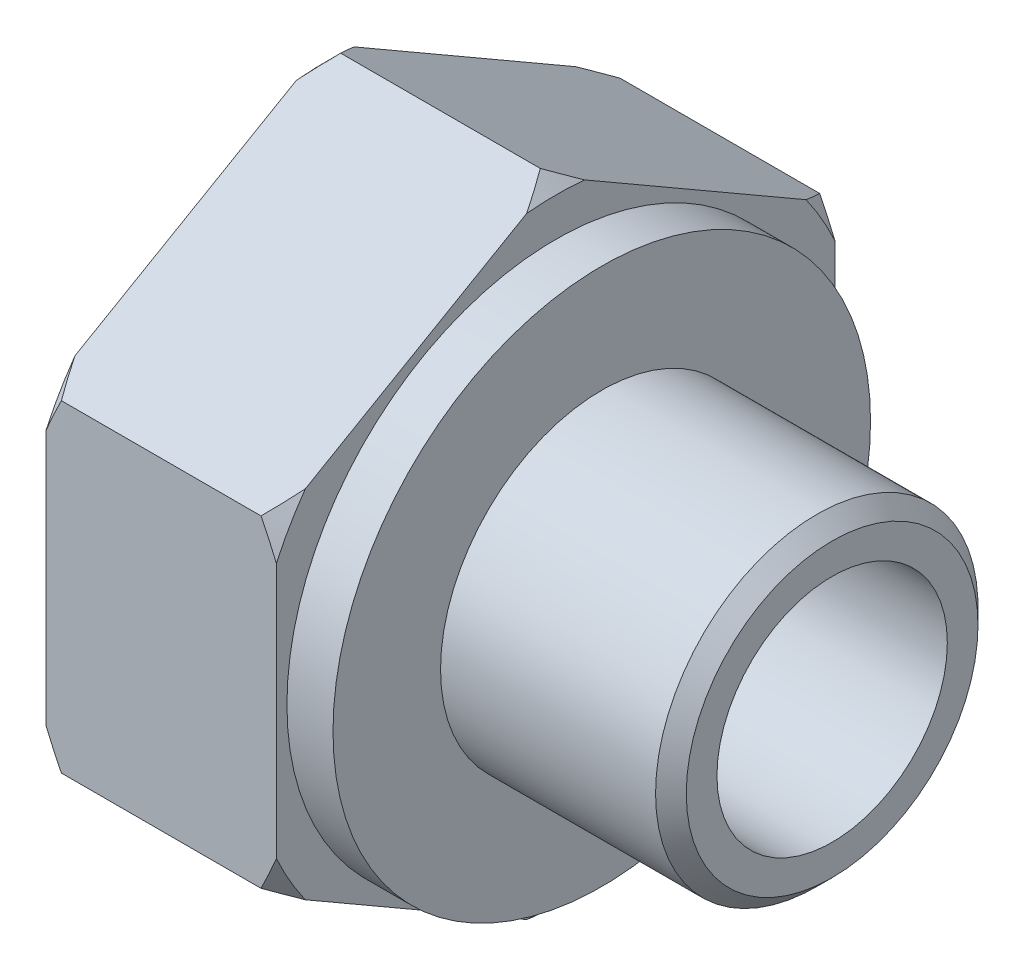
ISO-10303-21;
HEADER;
FILE_DESCRIPTION(('STEP AP214'),'2;1');
FILE_NAME('part.step','',(''),(''),'','','');
FILE_SCHEMA(('AUTOMOTIVE_DESIGN { 1 0 10303 214 1 1 1 1 }'));
ENDSEC;
DATA;
#1=APPLICATION_CONTEXT('core data for automotive mechanical design processes');
#2=APPLICATION_PROTOCOL_DEFINITION('international standard','automotive_design',2000,#1);
#3=PRODUCT_CONTEXT('',#1,'mechanical');
#4=PRODUCT('Part','Part','',(#3));
#5=PRODUCT_RELATED_PRODUCT_CATEGORY('part','',(#4));
#6=PRODUCT_DEFINITION_FORMATION('','',#4);
#7=PRODUCT_DEFINITION_CONTEXT('part definition',#1,'design');
#8=PRODUCT_DEFINITION('design','',#6,#7);
#9=PRODUCT_DEFINITION_SHAPE('','',#8);
#10=(LENGTH_UNIT() NAMED_UNIT(*) SI_UNIT(.MILLI.,.METRE.));
#11=(NAMED_UNIT(*) PLANE_ANGLE_UNIT() SI_UNIT($,.RADIAN.));
#12=(NAMED_UNIT(*) SI_UNIT($,.STERADIAN.) SOLID_ANGLE_UNIT());
#13=UNCERTAINTY_MEASURE_WITH_UNIT(LENGTH_MEASURE(1.E-05),#10,'distance_accuracy_value','');
#14=(GEOMETRIC_REPRESENTATION_CONTEXT(3) GLOBAL_UNCERTAINTY_ASSIGNED_CONTEXT((#13)) GLOBAL_UNIT_ASSIGNED_CONTEXT((#10,
#11,#12)) REPRESENTATION_CONTEXT('',''));
#15=CARTESIAN_POINT('',(0.,0.,0.));
#16=DIRECTION('',(0.,0.,1.));
#17=DIRECTION('',(1.,0.,0.));
#18=AXIS2_PLACEMENT_3D('',#15,#16,#17);
#19=CARTESIAN_POINT('',(28.2717056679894,17.5,0.));
#20=DIRECTION('',(-1.,0.,0.));
#21=DIRECTION('',(0.,0.,1.));
#22=AXIS2_PLACEMENT_3D('',#19,#20,#21);
#23=PLANE('',#22);
#24=CARTESIAN_POINT('',(28.2717056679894,0.,0.));
#25=DIRECTION('',(-1.,0.,0.));
#26=DIRECTION('',(0.,0.,1.));
#27=AXIS2_PLACEMENT_3D('',#24,#25,#26);
#28=CIRCLE('',#27,17.5);
#29=CARTESIAN_POINT('',(28.2717056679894,0.,17.5));
#30=VERTEX_POINT('',#29);
#31=EDGE_CURVE('E452',#30,#30,#28,.T.);
#32=ORIENTED_EDGE('',*,*,#31,.T.);
#33=EDGE_LOOP('',(#32));
#34=FACE_BOUND('',#33,.T.);
#35=DIRECTION('',(0.,0.499999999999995,-0.866025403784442));
#36=VECTOR('',#35,1.);
#37=CARTESIAN_POINT('',(28.2717056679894,20.125,1.51554445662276));
#38=LINE('',#37,#36);
#39=CARTESIAN_POINT('',(28.2717056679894,11.5891707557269,16.3000343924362));
#40=VERTEX_POINT('',#39);
#41=CARTESIAN_POINT('',(28.2717056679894,19.9108292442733,1.88649908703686));
#42=VERTEX_POINT('',#41);
#43=EDGE_CURVE('E284',#40,#42,#38,.T.);
#44=ORIENTED_EDGE('',*,*,#43,.F.);
#45=CARTESIAN_POINT('',(28.2717056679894,0.,0.));
#46=DIRECTION('',(-1.,0.,0.));
#47=DIRECTION('',(0.,0.,1.));
#48=AXIS2_PLACEMENT_3D('',#45,#46,#47);
#49=CIRCLE('',#48,20.);
#50=CARTESIAN_POINT('',(28.2717056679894,8.32165848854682,18.1865334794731));
#51=VERTEX_POINT('',#50);
#52=EDGE_CURVE('E203',#40,#51,#49,.F.);
#53=ORIENTED_EDGE('',*,*,#52,.T.);
#54=DIRECTION('',(0.,1.,0.));
#55=VECTOR('',#54,1.);
#56=CARTESIAN_POINT('',(28.2717056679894,17.5000000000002,18.186533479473));
#57=LINE('',#56,#55);
#58=CARTESIAN_POINT('',(28.2717056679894,-8.32165848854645,18.1865334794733));
#59=VERTEX_POINT('',#58);
#60=EDGE_CURVE('E283',#59,#51,#57,.T.);
#61=ORIENTED_EDGE('',*,*,#60,.F.);
#62=CARTESIAN_POINT('',(28.2717056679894,-11.5891707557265,16.3000343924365));
#63=VERTEX_POINT('',#62);
#64=EDGE_CURVE('E206',#59,#63,#49,.F.);
#65=ORIENTED_EDGE('',*,*,#64,.T.);
#66=DIRECTION('',(0.,0.500000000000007,0.866025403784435));
#67=VECTOR('',#66,1.);
#68=CARTESIAN_POINT('',(28.2717056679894,-11.3749999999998,16.6709890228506));
#69=LINE('',#68,#67);
#70=CARTESIAN_POINT('',(28.2717056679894,-19.9108292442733,1.88649908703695));
#71=VERTEX_POINT('',#70);
#72=EDGE_CURVE('E349',#71,#63,#69,.T.);
#73=ORIENTED_EDGE('',*,*,#72,.F.);
#74=CARTESIAN_POINT('',(28.2717056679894,-19.9108292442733,-1.8864990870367));
#75=VERTEX_POINT('',#74);
#76=EDGE_CURVE('E210',#71,#75,#49,.F.);
#77=ORIENTED_EDGE('',*,*,#76,.T.);
#78=DIRECTION('',(0.,-0.499999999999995,0.866025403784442));
#79=VECTOR('',#78,1.);
#80=CARTESIAN_POINT('',(28.2717056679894,-11.3750000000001,-16.6709890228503));
#81=LINE('',#80,#79);
#82=CARTESIAN_POINT('',(28.2717056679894,-11.5891707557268,-16.3000343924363));
#83=VERTEX_POINT('',#82);
#84=EDGE_CURVE('E359',#83,#75,#81,.T.);
#85=ORIENTED_EDGE('',*,*,#84,.F.);
#86=CARTESIAN_POINT('',(28.2717056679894,-8.3216584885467,-18.1865334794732));
#87=VERTEX_POINT('',#86);
#88=EDGE_CURVE('E334',#83,#87,#49,.F.);
#89=ORIENTED_EDGE('',*,*,#88,.T.);
#90=DIRECTION('',(0.,-1.,0.));
#91=VECTOR('',#90,1.);
#92=CARTESIAN_POINT('',(28.2717056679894,17.4999999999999,-18.1865334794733));
#93=LINE('',#92,#91);
#94=CARTESIAN_POINT('',(28.2717056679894,8.32165848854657,-18.1865334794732));
#95=VERTEX_POINT('',#94);
#96=EDGE_CURVE('E189',#95,#87,#93,.T.);
#97=ORIENTED_EDGE('',*,*,#96,.F.);
#98=CARTESIAN_POINT('',(28.2717056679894,11.5891707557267,-16.3000343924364));
#99=VERTEX_POINT('',#98);
#100=EDGE_CURVE('E333',#95,#99,#49,.F.);
#101=ORIENTED_EDGE('',*,*,#100,.T.);
#102=DIRECTION('',(0.,-0.500000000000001,-0.866025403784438));
#103=VECTOR('',#102,1.);
#104=CARTESIAN_POINT('',(28.2717056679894,20.125,-1.51554445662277));
#105=LINE('',#104,#103);
#106=CARTESIAN_POINT('',(28.2717056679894,19.9108292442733,-1.88649908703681));
#107=VERTEX_POINT('',#106);
#108=EDGE_CURVE('E240',#107,#99,#105,.T.);
#109=ORIENTED_EDGE('',*,*,#108,.F.);
#110=EDGE_CURVE('E326',#107,#42,#49,.F.);
#111=ORIENTED_EDGE('',*,*,#110,.T.);
#112=EDGE_LOOP('',(#44,#53,#61,#65,#73,#77,#85,#89,#97,#101,#109,#111));
#113=FACE_BOUND('',#112,.T.);
#114=ADVANCED_FACE('F40',(#34,#113),#23,.F.);
#115=CARTESIAN_POINT('',(27.2717056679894,0.,0.));
#116=DIRECTION('',(-1.,0.,0.));
#117=DIRECTION('',(0.,0.,1.));
#118=AXIS2_PLACEMENT_3D('',#115,#116,#117);
#119=CONICAL_SURFACE('',#118,21.,0.785398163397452);
#120=ORIENTED_EDGE('',*,*,#52,.F.);
#121=CARTESIAN_POINT('',(17.3031481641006,28.2829720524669,-12.6144776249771));
#122=CARTESIAN_POINT('',(17.7071561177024,28.0333694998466,-12.1821533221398));
#123=CARTESIAN_POINT('',(18.1087146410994,27.7827665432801,-11.7480962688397));
#124=CARTESIAN_POINT('',(18.9059883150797,27.2792108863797,-10.8759122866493));
#125=CARTESIAN_POINT('',(19.3017029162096,27.026257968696,-10.4377849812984));
#126=CARTESIAN_POINT('',(20.0872378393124,26.5170715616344,-9.55584825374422));
#127=CARTESIAN_POINT('',(20.4770411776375,26.2608315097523,-9.11202746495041));
#128=CARTESIAN_POINT('',(21.2484507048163,25.7452913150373,-8.2190856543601));
#129=CARTESIAN_POINT('',(21.6300571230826,25.4859912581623,-7.76996478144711));
#130=CARTESIAN_POINT('',(22.3941286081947,24.956481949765,-6.85282775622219));
#131=CARTESIAN_POINT('',(22.7763136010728,24.6861714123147,-6.38463617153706));
#132=CARTESIAN_POINT('',(23.5281596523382,24.1411978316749,-5.4407142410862));
#133=CARTESIAN_POINT('',(23.8978200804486,23.86653457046,-4.96498351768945));
#134=CARTESIAN_POINT('',(24.6214335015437,23.3124300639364,-4.00524635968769));
#135=CARTESIAN_POINT('',(24.9754008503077,23.0329935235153,-3.52124807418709));
#136=CARTESIAN_POINT('',(25.6643121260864,22.4683414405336,-2.54324197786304));
#137=CARTESIAN_POINT('',(25.9992585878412,22.1831266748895,-2.04923551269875));
#138=CARTESIAN_POINT('',(26.6498564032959,21.6021215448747,-1.04290510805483));
#139=CARTESIAN_POINT('',(26.9651852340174,21.3062402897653,-0.530423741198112));
#140=CARTESIAN_POINT('',(27.5652736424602,20.7067061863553,0.507999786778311));
#141=CARTESIAN_POINT('',(27.8500289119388,20.4030522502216,1.03394383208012));
#142=CARTESIAN_POINT('',(28.3794838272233,19.7890480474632,2.09743030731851));
#143=CARTESIAN_POINT('',(28.6243969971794,19.4787442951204,2.6348921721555));
#144=CARTESIAN_POINT('',(29.0665813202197,18.8497173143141,3.7243988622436));
#145=CARTESIAN_POINT('',(29.263866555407,18.5309966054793,4.27643932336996));
#146=CARTESIAN_POINT('',(29.5685178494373,17.9473473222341,5.28734953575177));
#147=CARTESIAN_POINT('',(29.6858516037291,17.6837269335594,5.74395344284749));
#148=CARTESIAN_POINT('',(29.8775130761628,17.1525828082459,6.66392205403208));
#149=CARTESIAN_POINT('',(29.9518470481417,16.8850596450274,7.1272857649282));
#150=CARTESIAN_POINT('',(30.0536818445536,16.348207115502,8.05714162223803));
#151=CARTESIAN_POINT('',(30.0812596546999,16.0788814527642,8.52362735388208));
#152=CARTESIAN_POINT('',(30.088306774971,15.5400652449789,9.4568844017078));
#153=CARTESIAN_POINT('',(30.0677753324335,15.2705746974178,9.92365572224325));
#154=CARTESIAN_POINT('',(29.979867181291,14.7343380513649,10.8524448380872));
#155=CARTESIAN_POINT('',(29.9126281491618,14.4675862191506,11.3144725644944));
#156=CARTESIAN_POINT('',(29.7348759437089,13.9377420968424,12.232189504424));
#157=CARTESIAN_POINT('',(29.6243592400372,13.6746501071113,12.6878781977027));
#158=CARTESIAN_POINT('',(29.3645409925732,13.1525213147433,13.5922317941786));
#159=CARTESIAN_POINT('',(29.215124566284,12.8934989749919,14.0408716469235));
#160=CARTESIAN_POINT('',(28.8831039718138,12.380907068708,14.9287068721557));
#161=CARTESIAN_POINT('',(28.7005015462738,12.1273372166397,15.3679027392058));
#162=CARTESIAN_POINT('',(28.2331507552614,11.531050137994,16.4007022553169));
#163=CARTESIAN_POINT('',(27.9358588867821,11.1907996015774,16.990033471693));
#164=CARTESIAN_POINT('',(27.300000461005,10.5199990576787,18.1518940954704));
#165=CARTESIAN_POINT('',(26.9614104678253,10.1894546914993,18.7244137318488));
#166=CARTESIAN_POINT('',(26.2516252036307,9.53640567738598,19.8555278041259));
#167=CARTESIAN_POINT('',(25.8803630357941,9.21391934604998,20.4140905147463));
#168=CARTESIAN_POINT('',(25.1130212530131,8.57654962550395,21.518047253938));
#169=CARTESIAN_POINT('',(24.7169463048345,8.26166482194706,22.0634437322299));
#170=CARTESIAN_POINT('',(23.9034332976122,7.63691718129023,23.1455383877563));
#171=CARTESIAN_POINT('',(23.4859085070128,7.32708271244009,23.6821874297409));
#172=CARTESIAN_POINT('',(22.635141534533,6.71285916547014,24.7460538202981));
#173=CARTESIAN_POINT('',(22.2018987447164,6.40847029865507,25.2732708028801));
#174=CARTESIAN_POINT('',(21.3232243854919,5.80462426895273,26.3191628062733));
#175=CARTESIAN_POINT('',(20.8778060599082,5.5051622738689,26.8378461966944));
#176=CARTESIAN_POINT('',(19.9766857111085,4.91015274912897,27.8684329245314));
#177=CARTESIAN_POINT('',(19.5209840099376,4.61460509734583,28.3803364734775));
#178=CARTESIAN_POINT('',(18.9158520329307,4.22796209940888,29.0500217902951));
#179=CARTESIAN_POINT('',(18.7702446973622,4.13536432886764,29.2104058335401));
#180=CARTESIAN_POINT('',(18.4782199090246,3.95048018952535,29.5306345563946));
#181=CARTESIAN_POINT('',(18.3318024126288,3.85819383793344,29.6904792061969));
#182=CARTESIAN_POINT('',(18.0387501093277,3.67426072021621,30.0090607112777));
#183=CARTESIAN_POINT('',(17.892118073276,3.58261284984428,30.1677994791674));
#184=CARTESIAN_POINT('',(17.5981517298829,3.39960742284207,30.4847741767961));
#185=CARTESIAN_POINT('',(17.4508174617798,3.30824985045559,30.6430101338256));
#186=CARTESIAN_POINT('',(17.3031481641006,3.2170279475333,30.8010111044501));
#187=B_SPLINE_CURVE_WITH_KNOTS('',3,(#121,#122,#123,#124,#125,#126,#127,#128,#129,#130,#131,
#132,#133,#134,#135,#136,#137,#138,#139,#140,#141,#142,#143,#144,#145,#146,#147,#148,#149,#150,
#151,#152,#153,#154,#155,#156,#157,#158,#159,#160,#161,#162,#163,#164,#165,#166,#167,#168,#169,
#170,#171,#172,#173,#174,#175,#176,#177,#178,#179,#180,#181,#182,#183,#184,#185,#186),
.UNSPECIFIED.,.F.,.F.,(4,2,2,2,2,2,2,2,2,2,2,2,2,2,2,2,2,2,2,2,2,2,2,2,2,2,2,2,2,2,2,2,4),(0.,
1.92663068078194,3.85344136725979,5.78501386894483,7.71653223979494,9.70259594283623,
11.6887594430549,13.6730668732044,15.65710924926,17.6680058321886,19.679185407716,
21.6792036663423,23.6786298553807,25.2974868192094,26.9161082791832,28.5320620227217,
30.1480410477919,31.759276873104,33.3706441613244,34.9868253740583,36.602921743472,
38.8288500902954,41.0560475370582,43.2879163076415,45.519366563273,47.7606853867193,
50.0020909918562,52.2411486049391,54.4801361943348,55.1868813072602,55.893664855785,
56.5978538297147,57.3020039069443),.UNSPECIFIED.);
#188=CARTESIAN_POINT('',(27.2717056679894,10.5000000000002,18.1865334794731));
#189=VERTEX_POINT('',#188);
#190=EDGE_CURVE('E12',#40,#189,#187,.T.);
#191=ORIENTED_EDGE('',*,*,#190,.T.);
#192=CARTESIAN_POINT('',(18.8603290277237,23.1144776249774,18.186533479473));
#193=CARTESIAN_POINT('',(19.0647854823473,22.8543191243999,18.186533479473));
#194=CARTESIAN_POINT('',(19.2684295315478,22.5935226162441,18.186533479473));
#195=CARTESIAN_POINT('',(19.6739451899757,22.0705504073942,18.186533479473));
#196=CARTESIAN_POINT('',(19.8758167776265,21.8083746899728,18.186533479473));
#197=CARTESIAN_POINT('',(20.4786077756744,21.019549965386,18.186533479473));
#198=CARTESIAN_POINT('',(20.8766383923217,20.4906859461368,18.186533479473));
#199=CARTESIAN_POINT('',(21.6655403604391,19.4233858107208,18.186533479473));
#200=CARTESIAN_POINT('',(22.0563638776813,18.8849142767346,18.186533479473));
#201=CARTESIAN_POINT('',(22.8267733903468,17.80001337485,18.186533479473));
#202=CARTESIAN_POINT('',(23.2063599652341,17.2535844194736,18.186533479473));
#203=CARTESIAN_POINT('',(23.9705567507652,16.1238213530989,18.186533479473));
#204=CARTESIAN_POINT('',(24.3544647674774,15.540010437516,18.186533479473));
#205=CARTESIAN_POINT('',(25.1035764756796,14.3603587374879,18.186533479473));
#206=CARTESIAN_POINT('',(25.4687780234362,13.764516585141,18.1865334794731));
#207=CARTESIAN_POINT('',(26.1748806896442,12.5601445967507,18.1865334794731));
#208=CARTESIAN_POINT('',(26.5158295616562,11.9516429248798,18.1865334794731));
#209=CARTESIAN_POINT('',(27.1678626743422,10.7189442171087,18.1865334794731));
#210=CARTESIAN_POINT('',(27.478956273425,10.094752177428,18.1865334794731));
#211=CARTESIAN_POINT('',(28.0325127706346,8.89534608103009,18.1865334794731));
#212=CARTESIAN_POINT('',(28.2787528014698,8.32188927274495,18.1865334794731));
#213=CARTESIAN_POINT('',(28.7337635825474,7.16008914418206,18.1865334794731));
#214=CARTESIAN_POINT('',(28.9425307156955,6.57174439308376,18.1865334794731));
#215=CARTESIAN_POINT('',(29.312200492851,5.38748152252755,18.1865334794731));
#216=CARTESIAN_POINT('',(29.4736362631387,4.79173339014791,18.1865334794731));
#217=CARTESIAN_POINT('',(29.676258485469,3.88931556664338,18.1865334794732));
#218=CARTESIAN_POINT('',(29.7372147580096,3.58701312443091,18.1865334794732));
#219=CARTESIAN_POINT('',(29.8450726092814,2.97992566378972,18.1865334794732));
#220=CARTESIAN_POINT('',(29.8919760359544,2.67514097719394,18.1865334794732));
#221=CARTESIAN_POINT('',(29.9717010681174,2.05803284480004,18.1865334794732));
#222=CARTESIAN_POINT('',(30.0042480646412,1.74567378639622,18.1865334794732));
#223=CARTESIAN_POINT('',(30.0534077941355,1.11969752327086,18.1865334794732));
#224=CARTESIAN_POINT('',(30.07002054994,0.8060803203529,18.1865334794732));
#225=CARTESIAN_POINT('',(30.0870025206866,0.178425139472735,18.1865334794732));
#226=CARTESIAN_POINT('',(30.0873728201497,-0.135612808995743,18.1865334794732));
#227=CARTESIAN_POINT('',(30.0718658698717,-0.763286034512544,18.1865334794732));
#228=CARTESIAN_POINT('',(30.055988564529,-1.07692131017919,18.1865334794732));
#229=CARTESIAN_POINT('',(30.0082035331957,-1.70398452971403,18.1865334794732));
#230=CARTESIAN_POINT('',(29.9762440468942,-2.01740851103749,18.1865334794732));
#231=CARTESIAN_POINT('',(29.8968432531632,-2.64227655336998,18.1865334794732));
#232=CARTESIAN_POINT('',(29.8494019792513,-2.95372061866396,18.1865334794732));
#233=CARTESIAN_POINT('',(29.7398251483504,-3.57404550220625,18.1865334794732));
#234=CARTESIAN_POINT('',(29.6776878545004,-3.88292601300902,18.1865334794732));
#235=CARTESIAN_POINT('',(29.5396789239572,-4.49762303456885,18.1865334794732));
#236=CARTESIAN_POINT('',(29.4638047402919,-4.80343896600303,18.1865334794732));
#237=CARTESIAN_POINT('',(29.1639223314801,-5.91248611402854,18.1865334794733));
#238=CARTESIAN_POINT('',(28.901705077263,-6.70564802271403,18.1865334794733));
#239=CARTESIAN_POINT('',(28.4566633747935,-7.87504369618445,18.1865334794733));
#240=CARTESIAN_POINT('',(28.2996212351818,-8.26160659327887,18.1865334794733));
#241=CARTESIAN_POINT('',(27.9704618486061,-9.0283028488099,18.1865334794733));
#242=CARTESIAN_POINT('',(27.798345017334,-9.40843638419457,18.1865334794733));
#243=CARTESIAN_POINT('',(27.4398233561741,-10.1650942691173,18.1865334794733));
#244=CARTESIAN_POINT('',(27.2533275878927,-10.5415752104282,18.1865334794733));
#245=CARTESIAN_POINT('',(26.8688856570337,-11.2886343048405,18.1865334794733));
#246=CARTESIAN_POINT('',(26.6709394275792,-11.65921242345,18.1865334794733));
#247=CARTESIAN_POINT('',(26.2651997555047,-12.3947723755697,18.1865334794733));
#248=CARTESIAN_POINT('',(26.0574093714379,-12.7597559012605,18.1865334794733));
#249=CARTESIAN_POINT('',(25.6332292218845,-13.4846953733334,18.1865334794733));
#250=CARTESIAN_POINT('',(25.416839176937,-13.8446511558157,18.1865334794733));
#251=CARTESIAN_POINT('',(24.9552041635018,-14.5946873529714,18.1865334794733));
#252=CARTESIAN_POINT('',(24.7091978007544,-14.9842984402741,18.1865334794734));
#253=CARTESIAN_POINT('',(24.209429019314,-15.7585072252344,18.1865334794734));
#254=CARTESIAN_POINT('',(23.9556665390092,-16.1431048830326,18.1865334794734));
#255=CARTESIAN_POINT('',(23.4413843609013,-16.9078367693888,18.1865334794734));
#256=CARTESIAN_POINT('',(23.180863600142,-17.2879702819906,18.1865334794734));
#257=CARTESIAN_POINT('',(22.6539730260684,-18.0441616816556,18.1865334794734));
#258=CARTESIAN_POINT('',(22.387603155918,-18.4202195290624,18.1865334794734));
#259=CARTESIAN_POINT('',(21.8554274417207,-19.1607577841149,18.1865334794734));
#260=CARTESIAN_POINT('',(21.5897283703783,-19.5253150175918,18.1865334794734));
#261=CARTESIAN_POINT('',(21.054010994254,-20.2512438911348,18.1865334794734));
#262=CARTESIAN_POINT('',(20.7839926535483,-20.6126155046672,18.1865334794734));
#263=CARTESIAN_POINT('',(20.2403086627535,-21.3322480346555,18.1865334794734));
#264=CARTESIAN_POINT('',(19.9666453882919,-21.6905107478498,18.1865334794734));
#265=CARTESIAN_POINT('',(19.4159289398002,-22.4044015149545,18.1865334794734));
#266=CARTESIAN_POINT('',(19.13887588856,-22.7600296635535,18.1865334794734));
#267=CARTESIAN_POINT('',(18.8603290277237,-23.114477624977,18.1865334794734));
#268=B_SPLINE_CURVE_WITH_KNOTS('',3,(#192,#193,#194,#195,#196,#197,#198,#199,#200,#201,#202,
#203,#204,#205,#206,#207,#208,#209,#210,#211,#212,#213,#214,#215,#216,#217,#218,#219,#220,#221,
#222,#223,#224,#225,#226,#227,#228,#229,#230,#231,#232,#233,#234,#235,#236,#237,#238,#239,#240,
#241,#242,#243,#244,#245,#246,#247,#248,#249,#250,#251,#252,#253,#254,#255,#256,#257,#258,#259,
#260,#261,#262,#263,#264,#265,#266,#267),.UNSPECIFIED.,.F.,.F.,(4,2,2,2,2,2,2,2,2,2,2,2,2,2,2,2,
2,2,2,2,2,2,2,2,2,2,2,2,2,2,2,2,2,2,2,2,2,4),(0.,0.992652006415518,1.9853160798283,
3.97095948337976,5.96690068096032,7.96273877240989,10.0586355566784,12.1547719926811,
14.246659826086,16.3378897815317,18.2090773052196,20.0804453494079,21.9298447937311,
22.8547288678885,23.77949126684,24.7212472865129,25.6630019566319,26.6046937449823,
27.5463887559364,28.4911341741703,29.4358775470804,30.3807326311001,31.3257630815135,
33.8268012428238,35.0783551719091,36.3298745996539,37.5900868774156,38.8503065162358,
40.110137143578,41.3700087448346,42.7522334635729,44.1344691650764,45.5169236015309,
46.8993914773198,48.2526785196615,49.6059768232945,50.9584325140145,52.3108393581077),.UNSPECIFIED.);
#269=EDGE_CURVE('E54',#189,#51,#268,.T.);
#270=ORIENTED_EDGE('',*,*,#269,.T.);
#271=EDGE_LOOP('',(#120,#191,#270));
#272=FACE_BOUND('',#271,.T.);
#273=ADVANCED_FACE('F222',(#272),#119,.T.);
#274=ORIENTED_EDGE('',*,*,#64,.F.);
#275=CARTESIAN_POINT('',(27.2717056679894,-10.4999999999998,18.1865334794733));
#276=VERTEX_POINT('',#275);
#277=EDGE_CURVE('E44',#59,#276,#268,.T.);
#278=ORIENTED_EDGE('',*,*,#277,.T.);
#279=CARTESIAN_POINT('',(17.3031481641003,-3.21702794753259,30.8010111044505));
#280=CARTESIAN_POINT('',(17.7071561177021,-3.46663050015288,30.3686868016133));
#281=CARTESIAN_POINT('',(18.1087146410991,-3.71723345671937,29.9346297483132));
#282=CARTESIAN_POINT('',(18.9059883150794,-4.22078911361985,29.0624457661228));
#283=CARTESIAN_POINT('',(19.3017029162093,-4.47374203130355,28.6243184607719));
#284=CARTESIAN_POINT('',(20.087237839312,-4.98292843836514,27.7423817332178));
#285=CARTESIAN_POINT('',(20.4770411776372,-5.2391684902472,27.298560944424));
#286=CARTESIAN_POINT('',(21.248450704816,-5.75470868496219,26.4056191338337));
#287=CARTESIAN_POINT('',(21.6300571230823,-6.01400874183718,25.9564982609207));
#288=CARTESIAN_POINT('',(22.3941286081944,-6.54351805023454,25.0393612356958));
#289=CARTESIAN_POINT('',(22.7763136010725,-6.81382858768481,24.5711696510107));
#290=CARTESIAN_POINT('',(23.5281596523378,-7.3588021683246,23.6272477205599));
#291=CARTESIAN_POINT('',(23.8978200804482,-7.63346542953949,23.1515169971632));
#292=CARTESIAN_POINT('',(24.6214335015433,-8.18756993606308,22.1917798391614));
#293=CARTESIAN_POINT('',(24.9754008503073,-8.46700647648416,21.7077815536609));
#294=CARTESIAN_POINT('',(25.664312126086,-9.03165855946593,20.7297754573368));
#295=CARTESIAN_POINT('',(25.9992585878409,-9.31687332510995,20.2357689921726));
#296=CARTESIAN_POINT('',(26.6498564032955,-9.89787845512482,19.2294385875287));
#297=CARTESIAN_POINT('',(26.9651852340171,-10.1937597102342,18.7169572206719));
#298=CARTESIAN_POINT('',(27.5652736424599,-10.7932938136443,17.6785336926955));
#299=CARTESIAN_POINT('',(27.8500289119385,-11.096947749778,17.1525896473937));
#300=CARTESIAN_POINT('',(28.3794838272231,-11.7109519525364,16.0891031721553));
#301=CARTESIAN_POINT('',(28.6243969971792,-12.0212557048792,15.5516413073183));
#302=CARTESIAN_POINT('',(29.0665813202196,-12.6502826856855,14.4621346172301));
#303=CARTESIAN_POINT('',(29.2638665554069,-12.9690033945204,13.9100941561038));
#304=CARTESIAN_POINT('',(29.5685178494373,-13.5526526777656,12.8991839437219));
#305=CARTESIAN_POINT('',(29.685851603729,-13.8162730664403,12.4425800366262));
#306=CARTESIAN_POINT('',(29.8775130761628,-14.3474171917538,11.5226114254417));
#307=CARTESIAN_POINT('',(29.9518470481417,-14.6149403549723,11.0592477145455));
#308=CARTESIAN_POINT('',(30.0536818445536,-15.1517928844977,10.1293918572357));
#309=CARTESIAN_POINT('',(30.0812596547,-15.4211185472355,9.66290612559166));
#310=CARTESIAN_POINT('',(30.0883067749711,-15.9599347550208,8.72964907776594));
#311=CARTESIAN_POINT('',(30.0677753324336,-16.229425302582,8.26287775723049));
#312=CARTESIAN_POINT('',(29.9798671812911,-16.7656619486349,7.33408864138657));
#313=CARTESIAN_POINT('',(29.9126281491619,-17.0324137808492,6.8720609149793));
#314=CARTESIAN_POINT('',(29.7348759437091,-17.5622579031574,5.95434397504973));
#315=CARTESIAN_POINT('',(29.6243592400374,-17.8253498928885,5.49865528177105));
#316=CARTESIAN_POINT('',(29.3645409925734,-18.3474786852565,4.59430168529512));
#317=CARTESIAN_POINT('',(29.2151245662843,-18.606501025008,4.14566183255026));
#318=CARTESIAN_POINT('',(28.8831039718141,-19.1190929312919,3.25782660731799));
#319=CARTESIAN_POINT('',(28.700501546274,-19.3726627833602,2.81863074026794));
#320=CARTESIAN_POINT('',(28.2331507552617,-19.9689498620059,1.78583122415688));
#321=CARTESIAN_POINT('',(27.9358588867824,-20.3092003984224,1.19650000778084));
#322=CARTESIAN_POINT('',(27.3000004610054,-20.9800009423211,0.034639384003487));
#323=CARTESIAN_POINT('',(26.9614104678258,-21.3105453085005,-0.537880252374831));
#324=CARTESIAN_POINT('',(26.2516252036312,-21.9635943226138,-1.66899432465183));
#325=CARTESIAN_POINT('',(25.8803630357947,-22.2860806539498,-2.22755703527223));
#326=CARTESIAN_POINT('',(25.1130212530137,-22.9234503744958,-3.33151377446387));
#327=CARTESIAN_POINT('',(24.7169463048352,-23.2383351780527,-3.87691025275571));
#328=CARTESIAN_POINT('',(23.903433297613,-23.8630828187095,-4.95900490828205));
#329=CARTESIAN_POINT('',(23.4859085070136,-24.1729172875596,-5.49565395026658));
#330=CARTESIAN_POINT('',(22.6351415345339,-24.7871408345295,-6.55952034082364));
#331=CARTESIAN_POINT('',(22.2018987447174,-25.0915297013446,-7.08673732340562));
#332=CARTESIAN_POINT('',(21.323224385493,-25.6953757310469,-8.13262932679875));
#333=CARTESIAN_POINT('',(20.8778060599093,-25.9948377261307,-8.65131271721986));
#334=CARTESIAN_POINT('',(19.9766857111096,-26.5898472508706,-9.68189944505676));
#335=CARTESIAN_POINT('',(19.5209840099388,-26.8853949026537,-10.1938029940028));
#336=CARTESIAN_POINT('',(18.9158520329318,-27.2720379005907,-10.8634883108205));
#337=CARTESIAN_POINT('',(18.7702446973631,-27.3646356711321,-11.0238723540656));
#338=CARTESIAN_POINT('',(18.4782199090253,-27.5495198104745,-11.3441010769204));
#339=CARTESIAN_POINT('',(18.3318024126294,-27.6418061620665,-11.5039457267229));
#340=CARTESIAN_POINT('',(18.0387501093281,-27.8257392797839,-11.822527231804));
#341=CARTESIAN_POINT('',(17.8921180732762,-27.9173871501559,-11.9812659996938));
#342=CARTESIAN_POINT('',(17.5981517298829,-28.1003925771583,-12.2982406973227));
#343=CARTESIAN_POINT('',(17.4508174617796,-28.1917501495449,-12.4564766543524));
#344=CARTESIAN_POINT('',(17.3031481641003,-28.2829720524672,-12.6144776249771));
#345=B_SPLINE_CURVE_WITH_KNOTS('',3,(#279,#280,#281,#282,#283,#284,#285,#286,#287,#288,#289,
#290,#291,#292,#293,#294,#295,#296,#297,#298,#299,#300,#301,#302,#303,#304,#305,#306,#307,#308,
#309,#310,#311,#312,#313,#314,#315,#316,#317,#318,#319,#320,#321,#322,#323,#324,#325,#326,#327,
#328,#329,#330,#331,#332,#333,#334,#335,#336,#337,#338,#339,#340,#341,#342,#343,#344),
.UNSPECIFIED.,.F.,.F.,(4,2,2,2,2,2,2,2,2,2,2,2,2,2,2,2,2,2,2,2,2,2,2,2,2,2,2,2,2,2,2,2,4),(0.,
1.92663068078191,3.85344136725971,5.78501386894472,7.71653223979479,9.70259594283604,
11.6887594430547,13.6730668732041,15.6571092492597,17.6680058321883,19.6791854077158,
21.6792036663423,23.6786298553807,25.2974868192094,26.9161082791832,28.5320620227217,
30.1480410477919,31.759276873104,33.3706441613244,34.9868253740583,36.602921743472,
38.8288500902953,41.0560475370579,43.287916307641,45.5193665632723,47.7606853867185,
50.0020909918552,52.2411486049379,54.4801361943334,55.1868813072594,55.8936648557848,
56.5978538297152,57.3020039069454),.UNSPECIFIED.);
#346=EDGE_CURVE('E303',#276,#63,#345,.T.);
#347=ORIENTED_EDGE('',*,*,#346,.T.);
#348=EDGE_LOOP('',(#274,#278,#347));
#349=FACE_BOUND('',#348,.T.);
#350=ADVANCED_FACE('F344',(#349),#119,.T.);
#351=ORIENTED_EDGE('',*,*,#76,.F.);
#352=CARTESIAN_POINT('',(27.2717056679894,-21.,1.46642301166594E-13));
#353=VERTEX_POINT('',#352);
#354=EDGE_CURVE('E297',#71,#353,#345,.T.);
#355=ORIENTED_EDGE('',*,*,#354,.T.);
#356=CARTESIAN_POINT('',(17.3031481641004,-28.282972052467,12.6144776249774));
#357=CARTESIAN_POINT('',(17.7071561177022,-28.0333694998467,12.1821533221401));
#358=CARTESIAN_POINT('',(18.1087146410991,-27.7827665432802,11.74809626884));
#359=CARTESIAN_POINT('',(18.9059883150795,-27.2792108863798,10.8759122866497));
#360=CARTESIAN_POINT('',(19.3017029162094,-27.0262579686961,10.4377849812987));
#361=CARTESIAN_POINT('',(20.0872378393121,-26.5170715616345,9.55584825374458));
#362=CARTESIAN_POINT('',(20.4770411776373,-26.2608315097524,9.11202746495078));
#363=CARTESIAN_POINT('',(21.2484507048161,-25.7452913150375,8.21908565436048));
#364=CARTESIAN_POINT('',(21.6300571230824,-25.4859912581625,7.7699647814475));
#365=CARTESIAN_POINT('',(22.3941286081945,-24.9564819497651,6.85282775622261));
#366=CARTESIAN_POINT('',(22.7763136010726,-24.6861714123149,6.38463617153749));
#367=CARTESIAN_POINT('',(23.5281596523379,-24.1411978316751,5.44071424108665));
#368=CARTESIAN_POINT('',(23.8978200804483,-23.8665345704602,4.96498351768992));
#369=CARTESIAN_POINT('',(24.6214335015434,-23.3124300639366,4.00524635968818));
#370=CARTESIAN_POINT('',(24.9754008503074,-23.0329935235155,3.52124807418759));
#371=CARTESIAN_POINT('',(25.6643121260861,-22.4683414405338,2.54324197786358));
#372=CARTESIAN_POINT('',(25.999258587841,-22.1831266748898,2.04923551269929));
#373=CARTESIAN_POINT('',(26.6498564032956,-21.6021215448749,1.04290510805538));
#374=CARTESIAN_POINT('',(26.9651852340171,-21.3062402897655,0.530423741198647));
#375=CARTESIAN_POINT('',(27.56527364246,-20.7067061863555,-0.507999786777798));
#376=CARTESIAN_POINT('',(27.8500289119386,-20.4030522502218,-1.03394383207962));
#377=CARTESIAN_POINT('',(28.3794838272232,-19.7890480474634,-2.09743030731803));
#378=CARTESIAN_POINT('',(28.6243969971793,-19.4787442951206,-2.63489217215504));
#379=CARTESIAN_POINT('',(29.0665813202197,-18.8497173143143,-3.72439886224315));
#380=CARTESIAN_POINT('',(29.2638665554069,-18.5309966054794,-4.27643932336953));
#381=CARTESIAN_POINT('',(29.5685178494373,-17.9473473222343,-5.28734953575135));
#382=CARTESIAN_POINT('',(29.685851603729,-17.6837269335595,-5.74395344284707));
#383=CARTESIAN_POINT('',(29.8775130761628,-17.1525828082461,-6.66392205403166));
#384=CARTESIAN_POINT('',(29.9518470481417,-16.8850596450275,-7.12728576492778));
#385=CARTESIAN_POINT('',(30.0536818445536,-16.3482071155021,-8.05714162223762));
#386=CARTESIAN_POINT('',(30.0812596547,-16.0788814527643,-8.52362735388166));
#387=CARTESIAN_POINT('',(30.0883067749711,-15.5400652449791,-9.45688440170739));
#388=CARTESIAN_POINT('',(30.0677753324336,-15.2705746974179,-9.92365572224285));
#389=CARTESIAN_POINT('',(29.9798671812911,-14.734338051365,-10.8524448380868));
#390=CARTESIAN_POINT('',(29.9126281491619,-14.4675862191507,-11.314472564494));
#391=CARTESIAN_POINT('',(29.7348759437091,-13.9377420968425,-12.2321895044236));
#392=CARTESIAN_POINT('',(29.6243592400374,-13.6746501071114,-12.6878781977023));
#393=CARTESIAN_POINT('',(29.3645409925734,-13.1525213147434,-13.5922317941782));
#394=CARTESIAN_POINT('',(29.2151245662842,-12.893498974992,-14.0408716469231));
#395=CARTESIAN_POINT('',(28.883103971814,-12.3809070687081,-14.9287068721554));
#396=CARTESIAN_POINT('',(28.700501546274,-12.1273372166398,-15.3679027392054));
#397=CARTESIAN_POINT('',(28.2331507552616,-11.5310501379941,-16.4007022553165));
#398=CARTESIAN_POINT('',(27.9358588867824,-11.1907996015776,-16.9900334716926));
#399=CARTESIAN_POINT('',(27.3000004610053,-10.5199990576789,-18.1518940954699));
#400=CARTESIAN_POINT('',(26.9614104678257,-10.1894546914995,-18.7244137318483));
#401=CARTESIAN_POINT('',(26.2516252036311,-9.53640567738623,-19.8555278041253));
#402=CARTESIAN_POINT('',(25.8803630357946,-9.21391934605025,-20.4140905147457));
#403=CARTESIAN_POINT('',(25.1130212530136,-8.57654962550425,-21.5180472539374));
#404=CARTESIAN_POINT('',(24.716946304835,-8.26166482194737,-22.0634437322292));
#405=CARTESIAN_POINT('',(23.9034332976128,-7.63691718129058,-23.1455383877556));
#406=CARTESIAN_POINT('',(23.4859085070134,-7.32708271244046,-23.6821874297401));
#407=CARTESIAN_POINT('',(22.6351415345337,-6.71285916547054,-24.7460538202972));
#408=CARTESIAN_POINT('',(22.2018987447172,-6.40847029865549,-25.2732708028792));
#409=CARTESIAN_POINT('',(21.3232243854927,-5.80462426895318,-26.3191628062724));
#410=CARTESIAN_POINT('',(20.8778060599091,-5.50516227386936,-26.8378461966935));
#411=CARTESIAN_POINT('',(19.9766857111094,-4.91015274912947,-27.8684329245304));
#412=CARTESIAN_POINT('',(19.5209840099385,-4.61460509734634,-28.3803364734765));
#413=CARTESIAN_POINT('',(18.9158520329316,-4.22796209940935,-29.0500217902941));
#414=CARTESIAN_POINT('',(18.770244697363,-4.13536432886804,-29.2104058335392));
#415=CARTESIAN_POINT('',(18.4782199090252,-3.95048018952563,-29.5306345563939));
#416=CARTESIAN_POINT('',(18.3318024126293,-3.85819383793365,-29.6904792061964));
#417=CARTESIAN_POINT('',(18.038750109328,-3.67426072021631,-30.0090607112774));
#418=CARTESIAN_POINT('',(17.8921180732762,-3.58261284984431,-30.1677994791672));
#419=CARTESIAN_POINT('',(17.5981517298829,-3.39960742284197,-30.4847741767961));
#420=CARTESIAN_POINT('',(17.4508174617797,-3.30824985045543,-30.6430101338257));
#421=CARTESIAN_POINT('',(17.3031481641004,-3.21702794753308,-30.8010111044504));
#422=B_SPLINE_CURVE_WITH_KNOTS('',3,(#356,#357,#358,#359,#360,#361,#362,#363,#364,#365,#366,
#367,#368,#369,#370,#371,#372,#373,#374,#375,#376,#377,#378,#379,#380,#381,#382,#383,#384,#385,
#386,#387,#388,#389,#390,#391,#392,#393,#394,#395,#396,#397,#398,#399,#400,#401,#402,#403,#404,
#405,#406,#407,#408,#409,#410,#411,#412,#413,#414,#415,#416,#417,#418,#419,#420,#421),
.UNSPECIFIED.,.F.,.F.,(4,2,2,2,2,2,2,2,2,2,2,2,2,2,2,2,2,2,2,2,2,2,2,2,2,2,2,2,2,2,2,2,4),(0.,
1.92663068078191,3.85344136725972,5.78501386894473,7.71653223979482,9.70259594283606,
11.6887594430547,13.6730668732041,15.6571092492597,17.6680058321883,19.6791854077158,
21.6792036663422,23.6786298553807,25.2974868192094,26.9161082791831,28.5320620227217,
30.1480410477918,31.759276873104,33.3706441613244,34.9868253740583,36.602921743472,
38.8288500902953,41.0560475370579,43.2879163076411,45.5193665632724,47.7606853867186,
50.0020909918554,52.2411486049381,54.4801361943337,55.1868813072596,55.8936648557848,
56.597853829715,57.3020039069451),.UNSPECIFIED.);
#423=EDGE_CURVE('E304',#353,#75,#422,.T.);
#424=ORIENTED_EDGE('',*,*,#423,.T.);
#425=EDGE_LOOP('',(#351,#355,#424));
#426=FACE_BOUND('',#425,.T.);
#427=ADVANCED_FACE('F355',(#426),#119,.T.);
#428=ORIENTED_EDGE('',*,*,#88,.F.);
#429=CARTESIAN_POINT('',(27.2717056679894,-10.5000000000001,-18.1865334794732));
#430=VERTEX_POINT('',#429);
#431=EDGE_CURVE('E305',#83,#430,#422,.T.);
#432=ORIENTED_EDGE('',*,*,#431,.T.);
#433=CARTESIAN_POINT('',(18.8603290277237,-23.1144776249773,-18.1865334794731));
#434=CARTESIAN_POINT('',(19.0647854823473,-22.8543191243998,-18.1865334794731));
#435=CARTESIAN_POINT('',(19.2684295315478,-22.593522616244,-18.1865334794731));
#436=CARTESIAN_POINT('',(19.6739451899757,-22.0705504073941,-18.1865334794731));
#437=CARTESIAN_POINT('',(19.8758167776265,-21.8083746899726,-18.1865334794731));
#438=CARTESIAN_POINT('',(20.4786077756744,-21.0195499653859,-18.1865334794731));
#439=CARTESIAN_POINT('',(20.8766383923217,-20.4906859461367,-18.1865334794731));
#440=CARTESIAN_POINT('',(21.6655403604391,-19.4233858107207,-18.1865334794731));
#441=CARTESIAN_POINT('',(22.0563638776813,-18.8849142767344,-18.1865334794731));
#442=CARTESIAN_POINT('',(22.8267733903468,-17.8000133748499,-18.1865334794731));
#443=CARTESIAN_POINT('',(23.2063599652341,-17.2535844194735,-18.1865334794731));
#444=CARTESIAN_POINT('',(23.9705567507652,-16.1238213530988,-18.1865334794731));
#445=CARTESIAN_POINT('',(24.3544647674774,-15.5400104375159,-18.1865334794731));
#446=CARTESIAN_POINT('',(25.1035764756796,-14.3603587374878,-18.1865334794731));
#447=CARTESIAN_POINT('',(25.4687780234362,-13.7645165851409,-18.1865334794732));
#448=CARTESIAN_POINT('',(26.1748806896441,-12.5601445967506,-18.1865334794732));
#449=CARTESIAN_POINT('',(26.5158295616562,-11.9516429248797,-18.1865334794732));
#450=CARTESIAN_POINT('',(27.1678626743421,-10.7189442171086,-18.1865334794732));
#451=CARTESIAN_POINT('',(27.478956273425,-10.0947521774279,-18.1865334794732));
#452=CARTESIAN_POINT('',(28.0325127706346,-8.89534608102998,-18.1865334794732));
#453=CARTESIAN_POINT('',(28.2787528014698,-8.32188927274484,-18.1865334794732));
#454=CARTESIAN_POINT('',(28.7337635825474,-7.16008914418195,-18.1865334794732));
#455=CARTESIAN_POINT('',(28.9425307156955,-6.57174439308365,-18.1865334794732));
#456=CARTESIAN_POINT('',(29.312200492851,-5.38748152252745,-18.1865334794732));
#457=CARTESIAN_POINT('',(29.4736362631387,-4.79173339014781,-18.1865334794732));
#458=CARTESIAN_POINT('',(29.676258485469,-3.88931556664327,-18.1865334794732));
#459=CARTESIAN_POINT('',(29.7372147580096,-3.58701312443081,-18.1865334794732));
#460=CARTESIAN_POINT('',(29.8450726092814,-2.97992566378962,-18.1865334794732));
#461=CARTESIAN_POINT('',(29.8919760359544,-2.67514097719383,-18.1865334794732));
#462=CARTESIAN_POINT('',(29.9717010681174,-2.05803284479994,-18.1865334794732));
#463=CARTESIAN_POINT('',(30.0042480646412,-1.74567378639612,-18.1865334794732));
#464=CARTESIAN_POINT('',(30.0534077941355,-1.11969752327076,-18.1865334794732));
#465=CARTESIAN_POINT('',(30.07002054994,-0.806080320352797,-18.1865334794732));
#466=CARTESIAN_POINT('',(30.0870025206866,-0.178425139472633,-18.1865334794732));
#467=CARTESIAN_POINT('',(30.0873728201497,0.135612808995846,-18.1865334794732));
#468=CARTESIAN_POINT('',(30.0718658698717,0.763286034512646,-18.1865334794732));
#469=CARTESIAN_POINT('',(30.055988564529,1.07692131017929,-18.1865334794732));
#470=CARTESIAN_POINT('',(30.0082035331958,1.70398452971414,-18.1865334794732));
#471=CARTESIAN_POINT('',(29.9762440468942,2.01740851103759,-18.1865334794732));
#472=CARTESIAN_POINT('',(29.8968432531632,2.64227655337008,-18.1865334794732));
#473=CARTESIAN_POINT('',(29.8494019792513,2.95372061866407,-18.1865334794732));
#474=CARTESIAN_POINT('',(29.7398251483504,3.57404550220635,-18.1865334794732));
#475=CARTESIAN_POINT('',(29.6776878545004,3.88292601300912,-18.1865334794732));
#476=CARTESIAN_POINT('',(29.5396789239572,4.49762303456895,-18.1865334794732));
#477=CARTESIAN_POINT('',(29.4638047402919,4.80343896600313,-18.1865334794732));
#478=CARTESIAN_POINT('',(29.1639223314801,5.91248611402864,-18.1865334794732));
#479=CARTESIAN_POINT('',(28.901705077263,6.70564802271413,-18.1865334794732));
#480=CARTESIAN_POINT('',(28.4566633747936,7.87504369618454,-18.1865334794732));
#481=CARTESIAN_POINT('',(28.2996212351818,8.26160659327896,-18.1865334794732));
#482=CARTESIAN_POINT('',(27.9704618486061,9.02830284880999,-18.1865334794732));
#483=CARTESIAN_POINT('',(27.798345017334,9.40843638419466,-18.1865334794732));
#484=CARTESIAN_POINT('',(27.4398233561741,10.1650942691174,-18.1865334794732));
#485=CARTESIAN_POINT('',(27.2533275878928,10.5415752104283,-18.1865334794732));
#486=CARTESIAN_POINT('',(26.8688856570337,11.2886343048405,-18.1865334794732));
#487=CARTESIAN_POINT('',(26.6709394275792,11.6592124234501,-18.1865334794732));
#488=CARTESIAN_POINT('',(26.2651997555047,12.3947723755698,-18.1865334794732));
#489=CARTESIAN_POINT('',(26.0574093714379,12.7597559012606,-18.1865334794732));
#490=CARTESIAN_POINT('',(25.6332292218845,13.4846953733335,-18.1865334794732));
#491=CARTESIAN_POINT('',(25.416839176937,13.8446511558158,-18.1865334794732));
#492=CARTESIAN_POINT('',(24.9552041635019,14.5946873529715,-18.1865334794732));
#493=CARTESIAN_POINT('',(24.7091978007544,14.9842984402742,-18.1865334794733));
#494=CARTESIAN_POINT('',(24.2094290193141,15.7585072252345,-18.1865334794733));
#495=CARTESIAN_POINT('',(23.9556665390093,16.1431048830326,-18.1865334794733));
#496=CARTESIAN_POINT('',(23.4413843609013,16.9078367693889,-18.1865334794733));
#497=CARTESIAN_POINT('',(23.180863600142,17.2879702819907,-18.1865334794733));
#498=CARTESIAN_POINT('',(22.6539730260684,18.0441616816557,-18.1865334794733));
#499=CARTESIAN_POINT('',(22.387603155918,18.4202195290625,-18.1865334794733));
#500=CARTESIAN_POINT('',(21.8554274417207,19.160757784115,-18.1865334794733));
#501=CARTESIAN_POINT('',(21.5897283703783,19.5253150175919,-18.1865334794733));
#502=CARTESIAN_POINT('',(21.054010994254,20.2512438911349,-18.1865334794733));
#503=CARTESIAN_POINT('',(20.7839926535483,20.6126155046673,-18.1865334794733));
#504=CARTESIAN_POINT('',(20.2403086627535,21.3322480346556,-18.1865334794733));
#505=CARTESIAN_POINT('',(19.9666453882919,21.69051074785,-18.1865334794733));
#506=CARTESIAN_POINT('',(19.4159289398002,22.4044015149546,-18.1865334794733));
#507=CARTESIAN_POINT('',(19.13887588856,22.7600296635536,-18.1865334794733));
#508=CARTESIAN_POINT('',(18.8603290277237,23.1144776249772,-18.1865334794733));
#509=B_SPLINE_CURVE_WITH_KNOTS('',3,(#433,#434,#435,#436,#437,#438,#439,#440,#441,#442,#443,
#444,#445,#446,#447,#448,#449,#450,#451,#452,#453,#454,#455,#456,#457,#458,#459,#460,#461,#462,
#463,#464,#465,#466,#467,#468,#469,#470,#471,#472,#473,#474,#475,#476,#477,#478,#479,#480,#481,
#482,#483,#484,#485,#486,#487,#488,#489,#490,#491,#492,#493,#494,#495,#496,#497,#498,#499,#500,
#501,#502,#503,#504,#505,#506,#507,#508),.UNSPECIFIED.,.F.,.F.,(4,2,2,2,2,2,2,2,2,2,2,2,2,2,2,2,
2,2,2,2,2,2,2,2,2,2,2,2,2,2,2,2,2,2,2,2,2,4),(0.,0.992652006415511,1.98531607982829,
3.97095948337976,5.96690068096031,7.96273877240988,10.0586355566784,12.1547719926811,
14.246659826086,16.3378897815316,18.2090773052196,20.0804453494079,21.929844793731,
22.8547288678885,23.7794912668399,24.7212472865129,25.6630019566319,26.6046937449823,
27.5463887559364,28.4911341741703,29.4358775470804,30.3807326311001,31.3257630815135,
33.8268012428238,35.0783551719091,36.3298745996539,37.5900868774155,38.8503065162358,
40.110137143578,41.3700087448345,42.7522334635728,44.1344691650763,45.5169236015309,
46.8993914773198,48.2526785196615,49.6059768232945,50.9584325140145,52.3108393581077),.UNSPECIFIED.);
#510=EDGE_CURVE('E310',#430,#87,#509,.T.);
#511=ORIENTED_EDGE('',*,*,#510,.T.);
#512=EDGE_LOOP('',(#428,#432,#511));
#513=FACE_BOUND('',#512,.T.);
#514=ADVANCED_FACE('F361',(#513),#119,.T.);
#515=ORIENTED_EDGE('',*,*,#100,.F.);
#516=CARTESIAN_POINT('',(27.2717056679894,10.5,-18.1865334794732));
#517=VERTEX_POINT('',#516);
#518=EDGE_CURVE('E311',#95,#517,#509,.T.);
#519=ORIENTED_EDGE('',*,*,#518,.T.);
#520=CARTESIAN_POINT('',(17.3031481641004,3.21702794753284,-30.8010111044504));
#521=CARTESIAN_POINT('',(17.7071561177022,3.46663050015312,-30.3686868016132));
#522=CARTESIAN_POINT('',(18.1087146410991,3.71723345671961,-29.9346297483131));
#523=CARTESIAN_POINT('',(18.9059883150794,4.22078911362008,-29.0624457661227));
#524=CARTESIAN_POINT('',(19.3017029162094,4.47374203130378,-28.6243184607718));
#525=CARTESIAN_POINT('',(20.0872378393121,4.98292843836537,-27.7423817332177));
#526=CARTESIAN_POINT('',(20.4770411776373,5.23916849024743,-27.2985609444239));
#527=CARTESIAN_POINT('',(21.248450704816,5.7547086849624,-26.4056191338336));
#528=CARTESIAN_POINT('',(21.6300571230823,6.01400874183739,-25.9564982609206));
#529=CARTESIAN_POINT('',(22.3941286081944,6.54351805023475,-25.0393612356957));
#530=CARTESIAN_POINT('',(22.7763136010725,6.81382858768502,-24.5711696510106));
#531=CARTESIAN_POINT('',(23.5281596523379,7.35880216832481,-23.6272477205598));
#532=CARTESIAN_POINT('',(23.8978200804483,7.63346542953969,-23.151516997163));
#533=CARTESIAN_POINT('',(24.6214335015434,8.18756993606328,-22.1917798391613));
#534=CARTESIAN_POINT('',(24.9754008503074,8.46700647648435,-21.7077815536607));
#535=CARTESIAN_POINT('',(25.6643121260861,9.03165855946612,-20.7297754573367));
#536=CARTESIAN_POINT('',(25.9992585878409,9.31687332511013,-20.2357689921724));
#537=CARTESIAN_POINT('',(26.6498564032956,9.89787845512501,-19.2294385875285));
#538=CARTESIAN_POINT('',(26.9651852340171,10.1937597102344,-18.7169572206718));
#539=CARTESIAN_POINT('',(27.5652736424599,10.7932938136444,-17.6785336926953));
#540=CARTESIAN_POINT('',(27.8500289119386,11.0969477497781,-17.1525896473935));
#541=CARTESIAN_POINT('',(28.3794838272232,11.7109519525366,-16.0891031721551));
#542=CARTESIAN_POINT('',(28.6243969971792,12.0212557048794,-15.5516413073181));
#543=CARTESIAN_POINT('',(29.0665813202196,12.6502826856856,-14.46213461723));
#544=CARTESIAN_POINT('',(29.2638665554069,12.9690033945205,-13.9100941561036));
#545=CARTESIAN_POINT('',(29.5685178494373,13.5526526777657,-12.8991839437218));
#546=CARTESIAN_POINT('',(29.685851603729,13.8162730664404,-12.4425800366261));
#547=CARTESIAN_POINT('',(29.8775130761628,14.3474171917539,-11.5226114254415));
#548=CARTESIAN_POINT('',(29.9518470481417,14.6149403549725,-11.0592477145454));
#549=CARTESIAN_POINT('',(30.0536818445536,15.1517928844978,-10.1293918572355));
#550=CARTESIAN_POINT('',(30.0812596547,15.4211185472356,-9.6629061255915));
#551=CARTESIAN_POINT('',(30.0883067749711,15.9599347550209,-8.72964907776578));
#552=CARTESIAN_POINT('',(30.0677753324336,16.2294253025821,-8.26287775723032));
#553=CARTESIAN_POINT('',(29.9798671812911,16.765661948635,-7.3340886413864));
#554=CARTESIAN_POINT('',(29.9126281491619,17.0324137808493,-6.87206091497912));
#555=CARTESIAN_POINT('',(29.7348759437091,17.5622579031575,-5.95434397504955));
#556=CARTESIAN_POINT('',(29.6243592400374,17.8253498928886,-5.49865528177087));
#557=CARTESIAN_POINT('',(29.3645409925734,18.3474786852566,-4.59430168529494));
#558=CARTESIAN_POINT('',(29.2151245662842,18.6065010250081,-4.14566183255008));
#559=CARTESIAN_POINT('',(28.883103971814,19.1190929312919,-3.2578266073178));
#560=CARTESIAN_POINT('',(28.700501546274,19.3726627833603,-2.81863074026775));
#561=CARTESIAN_POINT('',(28.2331507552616,19.9689498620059,-1.78583122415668));
#562=CARTESIAN_POINT('',(27.9358588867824,20.3092003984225,-1.19650000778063));
#563=CARTESIAN_POINT('',(27.3000004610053,20.9800009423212,-0.0346393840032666));
#564=CARTESIAN_POINT('',(26.9614104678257,21.3105453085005,0.537880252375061));
#565=CARTESIAN_POINT('',(26.2516252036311,21.9635943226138,1.66899432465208));
#566=CARTESIAN_POINT('',(25.8803630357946,22.2860806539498,2.22755703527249));
#567=CARTESIAN_POINT('',(25.1130212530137,22.9234503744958,3.33151377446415));
#568=CARTESIAN_POINT('',(24.7169463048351,23.2383351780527,3.876910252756));
#569=CARTESIAN_POINT('',(23.9034332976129,23.8630828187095,4.95900490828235));
#570=CARTESIAN_POINT('',(23.4859085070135,24.1729172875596,5.49565395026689));
#571=CARTESIAN_POINT('',(22.6351415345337,24.7871408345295,6.55952034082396));
#572=CARTESIAN_POINT('',(22.2018987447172,25.0915297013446,7.08673732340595));
#573=CARTESIAN_POINT('',(21.3232243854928,25.6953757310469,8.1326293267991));
#574=CARTESIAN_POINT('',(20.8778060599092,25.9948377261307,8.65131271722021));
#575=CARTESIAN_POINT('',(19.9766857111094,26.5898472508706,9.68189944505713));
#576=CARTESIAN_POINT('',(19.5209840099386,26.8853949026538,10.1938029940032));
#577=CARTESIAN_POINT('',(18.9158520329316,27.2720379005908,10.8634883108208));
#578=CARTESIAN_POINT('',(18.770244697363,27.3646356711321,11.023872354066));
#579=CARTESIAN_POINT('',(18.4782199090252,27.5495198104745,11.3441010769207));
#580=CARTESIAN_POINT('',(18.3318024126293,27.6418061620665,11.5039457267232));
#581=CARTESIAN_POINT('',(18.038750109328,27.8257392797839,11.8225272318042));
#582=CARTESIAN_POINT('',(17.8921180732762,27.9173871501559,11.981265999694));
#583=CARTESIAN_POINT('',(17.5981517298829,28.1003925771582,12.2982406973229));
#584=CARTESIAN_POINT('',(17.4508174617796,28.1917501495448,12.4564766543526));
#585=CARTESIAN_POINT('',(17.3031481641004,28.2829720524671,12.6144776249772));
#586=B_SPLINE_CURVE_WITH_KNOTS('',3,(#520,#521,#522,#523,#524,#525,#526,#527,#528,#529,#530,
#531,#532,#533,#534,#535,#536,#537,#538,#539,#540,#541,#542,#543,#544,#545,#546,#547,#548,#549,
#550,#551,#552,#553,#554,#555,#556,#557,#558,#559,#560,#561,#562,#563,#564,#565,#566,#567,#568,
#569,#570,#571,#572,#573,#574,#575,#576,#577,#578,#579,#580,#581,#582,#583,#584,#585),
.UNSPECIFIED.,.F.,.F.,(4,2,2,2,2,2,2,2,2,2,2,2,2,2,2,2,2,2,2,2,2,2,2,2,2,2,2,2,2,2,2,2,4),(0.,
1.92663068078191,3.85344136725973,5.78501386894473,7.71653223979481,9.70259594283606,
11.6887594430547,13.6730668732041,15.6571092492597,17.6680058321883,19.6791854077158,
21.6792036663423,23.6786298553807,25.2974868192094,26.9161082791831,28.5320620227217,
30.1480410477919,31.759276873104,33.3706441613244,34.9868253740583,36.602921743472,
38.8288500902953,41.0560475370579,43.2879163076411,45.5193665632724,47.7606853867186,
50.0020909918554,52.2411486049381,54.4801361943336,55.1868813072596,55.8936648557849,
56.5978538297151,57.3020039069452),.UNSPECIFIED.);
#587=EDGE_CURVE('E216',#517,#99,#586,.T.);
#588=ORIENTED_EDGE('',*,*,#587,.T.);
#589=EDGE_LOOP('',(#515,#519,#588));
#590=FACE_BOUND('',#589,.T.);
#591=ADVANCED_FACE('F526',(#590),#119,.T.);
#592=CARTESIAN_POINT('',(27.2717056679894,21.,0.));
#593=VERTEX_POINT('',#592);
#594=EDGE_CURVE('E209',#107,#593,#586,.T.);
#595=ORIENTED_EDGE('',*,*,#594,.T.);
#596=EDGE_CURVE('E56',#593,#42,#187,.T.);
#597=ORIENTED_EDGE('',*,*,#596,.T.);
#598=ORIENTED_EDGE('',*,*,#110,.F.);
#599=EDGE_LOOP('',(#595,#597,#598));
#600=FACE_BOUND('',#599,.T.);
#601=ADVANCED_FACE('F325',(#600),#119,.T.);
#602=CARTESIAN_POINT('',(-49.4341628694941,0.,0.));
#603=DIRECTION('',(-1.,0.,0.));
#604=DIRECTION('',(0.,0.,1.));
#605=AXIS2_PLACEMENT_3D('',#602,#603,#604);
#606=CYLINDRICAL_SURFACE('',#605,10.4974999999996);
#607=CARTESIAN_POINT('',(45.2717056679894,0.,0.));
#608=DIRECTION('',(-1.,0.,0.));
#609=DIRECTION('',(0.,0.,1.));
#610=AXIS2_PLACEMENT_3D('',#607,#608,#609);
#611=CIRCLE('',#610,10.4974999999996);
#612=CARTESIAN_POINT('',(45.2717056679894,0.,10.4974999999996));
#613=VERTEX_POINT('',#612);
#614=EDGE_CURVE('E447',#613,#613,#611,.T.);
#615=ORIENTED_EDGE('',*,*,#614,.T.);
#616=EDGE_LOOP('',(#615));
#617=FACE_BOUND('',#616,.T.);
#618=CARTESIAN_POINT('',(31.2717056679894,0.,0.));
#619=DIRECTION('',(-1.,0.,0.));
#620=DIRECTION('',(0.,0.,1.));
#621=AXIS2_PLACEMENT_3D('',#618,#619,#620);
#622=CIRCLE('',#621,10.4974999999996);
#623=CARTESIAN_POINT('',(31.2717056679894,0.,10.4974999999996));
#624=VERTEX_POINT('',#623);
#625=EDGE_CURVE('E459',#624,#624,#622,.T.);
#626=ORIENTED_EDGE('',*,*,#625,.F.);
#627=EDGE_LOOP('',(#626));
#628=FACE_BOUND('',#627,.T.);
#629=ADVANCED_FACE('F42',(#617,#628),#606,.T.);
#630=CARTESIAN_POINT('',(46.2717056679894,7.5,0.));
#631=DIRECTION('',(-1.,0.,0.));
#632=DIRECTION('',(0.,0.,1.));
#633=AXIS2_PLACEMENT_3D('',#630,#631,#632);
#634=PLANE('',#633);
#635=CARTESIAN_POINT('',(46.2717056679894,0.,0.));
#636=DIRECTION('',(-1.,0.,0.));
#637=DIRECTION('',(0.,0.,1.));
#638=AXIS2_PLACEMENT_3D('',#635,#636,#637);
#639=CIRCLE('',#638,9.49749999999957);
#640=CARTESIAN_POINT('',(46.2717056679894,0.,9.49749999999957));
#641=VERTEX_POINT('',#640);
#642=EDGE_CURVE('E198',#641,#641,#639,.F.);
#643=ORIENTED_EDGE('',*,*,#642,.T.);
#644=EDGE_LOOP('',(#643));
#645=FACE_BOUND('',#644,.T.);
#646=CARTESIAN_POINT('',(46.2717056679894,0.,0.));
#647=DIRECTION('',(-1.,0.,0.));
#648=DIRECTION('',(0.,0.,1.));
#649=AXIS2_PLACEMENT_3D('',#646,#647,#648);
#650=CIRCLE('',#649,7.5);
#651=CARTESIAN_POINT('',(46.2717056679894,0.,7.5));
#652=VERTEX_POINT('',#651);
#653=EDGE_CURVE('E446',#652,#652,#650,.T.);
#654=ORIENTED_EDGE('',*,*,#653,.T.);
#655=EDGE_LOOP('',(#654));
#656=FACE_BOUND('',#655,.T.);
#657=ADVANCED_FACE('F433',(#645,#656),#634,.F.);
#658=CARTESIAN_POINT('',(-49.4341628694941,0.,0.));
#659=DIRECTION('',(-1.,0.,0.));
#660=DIRECTION('',(0.,0.,1.));
#661=AXIS2_PLACEMENT_3D('',#658,#659,#660);
#662=CYLINDRICAL_SURFACE('',#661,7.5);
#663=ORIENTED_EDGE('',*,*,#653,.F.);
#664=EDGE_LOOP('',(#663));
#665=FACE_BOUND('',#664,.T.);
#666=CARTESIAN_POINT('',(23.2983804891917,0.,0.));
#667=DIRECTION('',(-1.,0.,0.));
#668=DIRECTION('',(0.,0.,1.));
#669=AXIS2_PLACEMENT_3D('',#666,#667,#668);
#670=CIRCLE('',#669,7.5);
#671=CARTESIAN_POINT('',(23.2983804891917,0.,7.5));
#672=VERTEX_POINT('',#671);
#673=EDGE_CURVE('E448',#672,#672,#670,.T.);
#674=ORIENTED_EDGE('',*,*,#673,.T.);
#675=EDGE_LOOP('',(#674));
#676=FACE_BOUND('',#675,.T.);
#677=ADVANCED_FACE('F430',(#665,#676),#662,.F.);
#678=CARTESIAN_POINT('',(23.2983804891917,7.5,0.));
#679=DIRECTION('',(-1.,0.,0.));
#680=DIRECTION('',(0.,0.,1.));
#681=AXIS2_PLACEMENT_3D('',#678,#679,#680);
#682=PLANE('',#681);
#683=ORIENTED_EDGE('',*,*,#673,.F.);
#684=EDGE_LOOP('',(#683));
#685=FACE_BOUND('',#684,.T.);
#686=ADVANCED_FACE('F427',(#685),#682,.F.);
#687=CARTESIAN_POINT('',(-49.4341628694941,0.,0.));
#688=DIRECTION('',(-1.,0.,0.));
#689=DIRECTION('',(0.,0.,1.));
#690=AXIS2_PLACEMENT_3D('',#687,#688,#689);
#691=CYLINDRICAL_SURFACE('',#690,17.5);
#692=ORIENTED_EDGE('',*,*,#31,.F.);
#693=EDGE_LOOP('',(#692));
#694=FACE_BOUND('',#693,.T.);
#695=CARTESIAN_POINT('',(31.2717056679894,0.,0.));
#696=DIRECTION('',(-1.,0.,0.));
#697=DIRECTION('',(0.,0.,1.));
#698=AXIS2_PLACEMENT_3D('',#695,#696,#697);
#699=CIRCLE('',#698,17.5);
#700=CARTESIAN_POINT('',(31.2717056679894,0.,17.5));
#701=VERTEX_POINT('',#700);
#702=EDGE_CURVE('E456',#701,#701,#699,.T.);
#703=ORIENTED_EDGE('',*,*,#702,.T.);
#704=EDGE_LOOP('',(#703));
#705=FACE_BOUND('',#704,.T.);
#706=ADVANCED_FACE('F424',(#694,#705),#691,.T.);
#707=CARTESIAN_POINT('',(31.2717056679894,10.4974999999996,0.));
#708=DIRECTION('',(-1.,0.,0.));
#709=DIRECTION('',(0.,0.,1.));
#710=AXIS2_PLACEMENT_3D('',#707,#708,#709);
#711=PLANE('',#710);
#712=ORIENTED_EDGE('',*,*,#702,.F.);
#713=EDGE_LOOP('',(#712));
#714=FACE_BOUND('',#713,.T.);
#715=ORIENTED_EDGE('',*,*,#625,.T.);
#716=EDGE_LOOP('',(#715));
#717=FACE_BOUND('',#716,.T.);
#718=ADVANCED_FACE('F470',(#714,#717),#711,.F.);
#719=CARTESIAN_POINT('',(45.2717056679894,0.,0.));
#720=DIRECTION('',(-1.,0.,0.));
#721=DIRECTION('',(0.,0.,1.));
#722=AXIS2_PLACEMENT_3D('',#719,#720,#721);
#723=CONICAL_SURFACE('',#722,10.4974999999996,0.785398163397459);
#724=ORIENTED_EDGE('',*,*,#642,.F.);
#725=EDGE_LOOP('',(#724));
#726=FACE_BOUND('',#725,.T.);
#727=ORIENTED_EDGE('',*,*,#614,.F.);
#728=EDGE_LOOP('',(#727));
#729=FACE_BOUND('',#728,.T.);
#730=ADVANCED_FACE('F249',(#726,#729),#723,.T.);
#731=CARTESIAN_POINT('',(46.2717056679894,10.5000000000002,18.1865334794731));
#732=DIRECTION('',(0.,0.866025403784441,0.499999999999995));
#733=DIRECTION('',(0.,-0.499999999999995,0.866025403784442));
#734=AXIS2_PLACEMENT_3D('',#731,#732,#733);
#735=PLANE('',#734);
#736=DIRECTION('',(-1.,0.,0.));
#737=VECTOR('',#736,1.);
#738=CARTESIAN_POINT('',(46.2717056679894,10.5000000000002,18.1865334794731));
#739=LINE('',#738,#737);
#740=CARTESIAN_POINT('',(14.2717056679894,10.5000000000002,18.1865334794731));
#741=VERTEX_POINT('',#740);
#742=EDGE_CURVE('E387',#189,#741,#739,.T.);
#743=ORIENTED_EDGE('',*,*,#742,.F.);
#744=ORIENTED_EDGE('',*,*,#190,.F.);
#745=ORIENTED_EDGE('',*,*,#43,.T.);
#746=ORIENTED_EDGE('',*,*,#596,.F.);
#747=DIRECTION('',(-1.,0.,0.));
#748=VECTOR('',#747,1.);
#749=CARTESIAN_POINT('',(46.2717056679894,21.,0.));
#750=LINE('',#749,#748);
#751=CARTESIAN_POINT('',(14.2717056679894,21.,0.));
#752=VERTEX_POINT('',#751);
#753=EDGE_CURVE('E70',#593,#752,#750,.T.);
#754=ORIENTED_EDGE('',*,*,#753,.T.);
#755=CARTESIAN_POINT('',(24.2402631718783,3.21702794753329,30.8010111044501));
#756=CARTESIAN_POINT('',(23.8362552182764,3.46663050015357,30.3686868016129));
#757=CARTESIAN_POINT('',(23.4346966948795,3.71723345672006,29.9346297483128));
#758=CARTESIAN_POINT('',(22.6374230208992,4.22078911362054,29.0624457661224));
#759=CARTESIAN_POINT('',(22.2417084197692,4.47374203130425,28.6243184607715));
#760=CARTESIAN_POINT('',(21.4561734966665,4.98292843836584,27.7423817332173));
#761=CARTESIAN_POINT('',(21.0663701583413,5.23916849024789,27.2985609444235));
#762=CARTESIAN_POINT('',(20.2949606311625,5.75470868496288,26.4056191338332));
#763=CARTESIAN_POINT('',(19.9133542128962,6.01400874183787,25.9564982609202));
#764=CARTESIAN_POINT('',(19.1492827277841,6.54351805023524,25.0393612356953));
#765=CARTESIAN_POINT('',(18.767097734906,6.81382858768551,24.5711696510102));
#766=CARTESIAN_POINT('',(18.0152516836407,7.3588021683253,23.6272477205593));
#767=CARTESIAN_POINT('',(17.6455912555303,7.63346542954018,23.1515169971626));
#768=CARTESIAN_POINT('',(16.9219778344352,8.18756993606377,22.1917798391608));
#769=CARTESIAN_POINT('',(16.5680104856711,8.46700647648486,21.7077815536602));
#770=CARTESIAN_POINT('',(15.8790992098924,9.03165855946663,20.7297754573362));
#771=CARTESIAN_POINT('',(15.5441527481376,9.31687332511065,20.2357689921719));
#772=CARTESIAN_POINT('',(14.893554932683,9.89787845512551,19.2294385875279));
#773=CARTESIAN_POINT('',(14.5782261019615,10.1937597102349,18.7169572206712));
#774=CARTESIAN_POINT('',(13.9781376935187,10.7932938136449,17.6785336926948));
#775=CARTESIAN_POINT('',(13.6933824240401,11.0969477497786,17.152589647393));
#776=CARTESIAN_POINT('',(13.1639275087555,11.710951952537,16.0891031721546));
#777=CARTESIAN_POINT('',(12.9190143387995,12.0212557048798,15.5516413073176));
#778=CARTESIAN_POINT('',(12.4768300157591,12.650282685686,14.4621346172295));
#779=CARTESIAN_POINT('',(12.2795447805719,12.9690033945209,13.9100941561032));
#780=CARTESIAN_POINT('',(11.9748934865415,13.5526526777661,12.8991839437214));
#781=CARTESIAN_POINT('',(11.8575597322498,13.8162730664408,12.4425800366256));
#782=CARTESIAN_POINT('',(11.665898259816,14.3474171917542,11.5226114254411));
#783=CARTESIAN_POINT('',(11.5915642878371,14.6149403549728,11.0592477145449));
#784=CARTESIAN_POINT('',(11.4897294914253,15.1517928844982,10.1293918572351));
#785=CARTESIAN_POINT('',(11.4621516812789,15.421118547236,9.66290612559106));
#786=CARTESIAN_POINT('',(11.4551045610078,15.9599347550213,8.72964907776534));
#787=CARTESIAN_POINT('',(11.4756360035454,16.2294253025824,8.26287775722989));
#788=CARTESIAN_POINT('',(11.5635441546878,16.7656619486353,7.33408864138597));
#789=CARTESIAN_POINT('',(11.630783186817,17.0324137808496,6.8720609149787));
#790=CARTESIAN_POINT('',(11.8085353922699,17.5622579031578,5.95434397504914));
#791=CARTESIAN_POINT('',(11.9190520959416,17.8253498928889,5.49865528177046));
#792=CARTESIAN_POINT('',(12.1788703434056,18.3474786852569,4.59430168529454));
#793=CARTESIAN_POINT('',(12.3282867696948,18.6065010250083,4.14566183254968));
#794=CARTESIAN_POINT('',(12.660307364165,19.1190929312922,3.25782660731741));
#795=CARTESIAN_POINT('',(12.842909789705,19.3726627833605,2.81863074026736));
#796=CARTESIAN_POINT('',(13.3102605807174,19.9689498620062,1.78583122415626));
#797=CARTESIAN_POINT('',(13.6075524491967,20.3092003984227,1.19650000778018));
#798=CARTESIAN_POINT('',(14.2434108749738,20.9800009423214,0.0346393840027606));
#799=CARTESIAN_POINT('',(14.5820008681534,21.3105453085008,-0.537880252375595));
#800=CARTESIAN_POINT('',(15.2917861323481,21.9635943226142,-1.66899432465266));
#801=CARTESIAN_POINT('',(15.6630483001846,22.2860806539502,-2.2275570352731));
#802=CARTESIAN_POINT('',(16.4303900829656,22.9234503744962,-3.33151377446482));
#803=CARTESIAN_POINT('',(16.8264650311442,23.2383351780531,-3.8769102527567));
#804=CARTESIAN_POINT('',(17.6399780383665,23.8630828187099,-4.9590049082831));
#805=CARTESIAN_POINT('',(18.0575028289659,24.17291728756,-5.49565395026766));
#806=CARTESIAN_POINT('',(18.9082698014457,24.78714083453,-6.55952034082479));
#807=CARTESIAN_POINT('',(19.3415125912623,25.091529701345,-7.0867373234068));
#808=CARTESIAN_POINT('',(20.2201869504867,25.6953757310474,-8.1326293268));
#809=CARTESIAN_POINT('',(20.6656052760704,25.9948377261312,-8.65131271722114));
#810=CARTESIAN_POINT('',(21.5667256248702,26.5898472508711,-9.6818994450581));
#811=CARTESIAN_POINT('',(22.0224273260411,26.8853949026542,-10.1938029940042));
#812=CARTESIAN_POINT('',(22.627559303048,27.2720379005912,-10.8634883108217));
#813=CARTESIAN_POINT('',(22.7731666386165,27.3646356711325,-11.0238723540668));
#814=CARTESIAN_POINT('',(23.0651914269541,27.5495198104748,-11.3441010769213));
#815=CARTESIAN_POINT('',(23.21160892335,27.6418061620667,-11.5039457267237));
#816=CARTESIAN_POINT('',(23.504661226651,27.8257392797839,-11.8225272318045));
#817=CARTESIAN_POINT('',(23.6512932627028,27.9173871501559,-11.9812659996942));
#818=CARTESIAN_POINT('',(23.9452596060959,28.1003925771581,-12.298240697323));
#819=CARTESIAN_POINT('',(24.0925938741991,28.1917501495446,-12.4564766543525));
#820=CARTESIAN_POINT('',(24.2402631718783,28.2829720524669,-12.6144776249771));
#821=B_SPLINE_CURVE_WITH_KNOTS('',3,(#755,#756,#757,#758,#759,#760,#761,#762,#763,#764,#765,
#766,#767,#768,#769,#770,#771,#772,#773,#774,#775,#776,#777,#778,#779,#780,#781,#782,#783,#784,
#785,#786,#787,#788,#789,#790,#791,#792,#793,#794,#795,#796,#797,#798,#799,#800,#801,#802,#803,
#804,#805,#806,#807,#808,#809,#810,#811,#812,#813,#814,#815,#816,#817,#818,#819,#820),
.UNSPECIFIED.,.F.,.F.,(4,2,2,2,2,2,2,2,2,2,2,2,2,2,2,2,2,2,2,2,2,2,2,2,2,2,2,2,2,2,2,2,4),(0.,
1.92663068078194,3.85344136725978,5.78501386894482,7.71653223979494,9.70259594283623,
11.6887594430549,13.6730668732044,15.65710924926,17.6680058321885,19.679185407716,
21.6792036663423,23.6786298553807,25.2974868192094,26.9161082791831,28.5320620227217,
30.1480410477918,31.7592768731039,33.3706441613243,34.9868253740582,36.6029217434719,
38.8288500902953,41.056047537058,43.2879163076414,45.5193665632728,47.7606853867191,
50.002090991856,52.2411486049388,54.4801361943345,55.1868813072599,55.8936648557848,
56.5978538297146,57.3020039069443),.UNSPECIFIED.);
#822=CARTESIAN_POINT('',(13.2717056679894,19.9108292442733,1.88649908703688));
#823=VERTEX_POINT('',#822);
#824=EDGE_CURVE('E188',#823,#752,#821,.T.);
#825=ORIENTED_EDGE('',*,*,#824,.F.);
#826=DIRECTION('',(0.,0.499999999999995,-0.866025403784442));
#827=VECTOR('',#826,1.);
#828=CARTESIAN_POINT('',(13.2717056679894,10.5000000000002,18.1865334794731));
#829=LINE('',#828,#827);
#830=CARTESIAN_POINT('',(13.2717056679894,11.5891707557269,16.3000343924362));
#831=VERTEX_POINT('',#830);
#832=EDGE_CURVE('E181',#831,#823,#829,.T.);
#833=ORIENTED_EDGE('',*,*,#832,.F.);
#834=EDGE_CURVE('E461',#741,#831,#821,.T.);
#835=ORIENTED_EDGE('',*,*,#834,.F.);
#836=EDGE_LOOP('',(#743,#744,#745,#746,#754,#825,#833,#835));
#837=FACE_BOUND('',#836,.T.);
#838=ADVANCED_FACE('F232',(#837),#735,.T.);
#839=CARTESIAN_POINT('',(46.2717056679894,-10.4999999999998,18.1865334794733));
#840=DIRECTION('',(0.,0.,1.));
#841=DIRECTION('',(0.,-1.,0.));
#842=AXIS2_PLACEMENT_3D('',#839,#840,#841);
#843=PLANE('',#842);
#844=DIRECTION('',(-1.,0.,0.));
#845=VECTOR('',#844,1.);
#846=CARTESIAN_POINT('',(46.2717056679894,-10.4999999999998,18.1865334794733));
#847=LINE('',#846,#845);
#848=CARTESIAN_POINT('',(14.2717056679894,-10.4999999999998,18.1865334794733));
#849=VERTEX_POINT('',#848);
#850=EDGE_CURVE('E372',#276,#849,#847,.T.);
#851=ORIENTED_EDGE('',*,*,#850,.F.);
#852=ORIENTED_EDGE('',*,*,#277,.F.);
#853=ORIENTED_EDGE('',*,*,#60,.T.);
#854=ORIENTED_EDGE('',*,*,#269,.F.);
#855=ORIENTED_EDGE('',*,*,#742,.T.);
#856=CARTESIAN_POINT('',(22.6830823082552,-23.114477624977,18.1865334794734));
#857=CARTESIAN_POINT('',(22.4786258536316,-22.8543191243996,18.1865334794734));
#858=CARTESIAN_POINT('',(22.274981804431,-22.5935226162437,18.1865334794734));
#859=CARTESIAN_POINT('',(21.8694661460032,-22.0705504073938,18.1865334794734));
#860=CARTESIAN_POINT('',(21.6675945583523,-21.8083746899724,18.1865334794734));
#861=CARTESIAN_POINT('',(21.0648035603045,-21.0195499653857,18.1865334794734));
#862=CARTESIAN_POINT('',(20.6667729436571,-20.4906859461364,18.1865334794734));
#863=CARTESIAN_POINT('',(19.8778709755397,-19.4233858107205,18.1865334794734));
#864=CARTESIAN_POINT('',(19.4870474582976,-18.8849142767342,18.1865334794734));
#865=CARTESIAN_POINT('',(18.716637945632,-17.8000133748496,18.1865334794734));
#866=CARTESIAN_POINT('',(18.3370513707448,-17.2535844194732,18.1865334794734));
#867=CARTESIAN_POINT('',(17.5728545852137,-16.1238213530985,18.1865334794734));
#868=CARTESIAN_POINT('',(17.1889465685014,-15.5400104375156,18.1865334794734));
#869=CARTESIAN_POINT('',(16.4398348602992,-14.3603587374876,18.1865334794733));
#870=CARTESIAN_POINT('',(16.0746333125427,-13.7645165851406,18.1865334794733));
#871=CARTESIAN_POINT('',(15.3685306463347,-12.5601445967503,18.1865334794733));
#872=CARTESIAN_POINT('',(15.0275817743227,-11.9516429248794,18.1865334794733));
#873=CARTESIAN_POINT('',(14.3755486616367,-10.7189442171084,18.1865334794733));
#874=CARTESIAN_POINT('',(14.0644550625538,-10.0947521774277,18.1865334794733));
#875=CARTESIAN_POINT('',(13.5108985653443,-8.89534608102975,18.1865334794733));
#876=CARTESIAN_POINT('',(13.264658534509,-8.32188927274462,18.1865334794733));
#877=CARTESIAN_POINT('',(12.8096477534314,-7.16008914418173,18.1865334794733));
#878=CARTESIAN_POINT('',(12.6008806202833,-6.57174439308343,18.1865334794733));
#879=CARTESIAN_POINT('',(12.2312108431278,-5.38748152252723,18.1865334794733));
#880=CARTESIAN_POINT('',(12.0697750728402,-4.7917333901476,18.1865334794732));
#881=CARTESIAN_POINT('',(11.8671528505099,-3.88931556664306,18.1865334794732));
#882=CARTESIAN_POINT('',(11.8061965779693,-3.5870131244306,18.1865334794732));
#883=CARTESIAN_POINT('',(11.6983387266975,-2.97992566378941,18.1865334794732));
#884=CARTESIAN_POINT('',(11.6514353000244,-2.67514097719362,18.1865334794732));
#885=CARTESIAN_POINT('',(11.5717102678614,-2.05803284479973,18.1865334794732));
#886=CARTESIAN_POINT('',(11.5391632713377,-1.74567378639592,18.1865334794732));
#887=CARTESIAN_POINT('',(11.4900035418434,-1.11969752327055,18.1865334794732));
#888=CARTESIAN_POINT('',(11.4733907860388,-0.806080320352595,18.1865334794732));
#889=CARTESIAN_POINT('',(11.4564088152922,-0.178425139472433,18.1865334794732));
#890=CARTESIAN_POINT('',(11.4560385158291,0.135612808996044,18.1865334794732));
#891=CARTESIAN_POINT('',(11.4715454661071,0.763286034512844,18.1865334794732));
#892=CARTESIAN_POINT('',(11.4874227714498,1.07692131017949,18.1865334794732));
#893=CARTESIAN_POINT('',(11.5352078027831,1.70398452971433,18.1865334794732));
#894=CARTESIAN_POINT('',(11.5671672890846,2.01740851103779,18.1865334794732));
#895=CARTESIAN_POINT('',(11.6465680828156,2.64227655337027,18.1865334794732));
#896=CARTESIAN_POINT('',(11.6940093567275,2.95372061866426,18.1865334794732));
#897=CARTESIAN_POINT('',(11.8035861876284,3.57404550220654,18.1865334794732));
#898=CARTESIAN_POINT('',(11.8657234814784,3.88292601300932,18.1865334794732));
#899=CARTESIAN_POINT('',(12.0037324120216,4.49762303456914,18.1865334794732));
#900=CARTESIAN_POINT('',(12.0796065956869,4.80343896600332,18.1865334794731));
#901=CARTESIAN_POINT('',(12.3794890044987,5.91248611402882,18.1865334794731));
#902=CARTESIAN_POINT('',(12.6417062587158,6.7056480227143,18.1865334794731));
#903=CARTESIAN_POINT('',(13.0867479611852,7.87504369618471,18.1865334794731));
#904=CARTESIAN_POINT('',(13.243790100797,8.26160659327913,18.1865334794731));
#905=CARTESIAN_POINT('',(13.5729494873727,9.02830284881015,18.1865334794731));
#906=CARTESIAN_POINT('',(13.7450663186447,9.40843638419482,18.1865334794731));
#907=CARTESIAN_POINT('',(14.1035879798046,10.1650942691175,18.1865334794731));
#908=CARTESIAN_POINT('',(14.290083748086,10.5415752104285,18.1865334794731));
#909=CARTESIAN_POINT('',(14.6745256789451,11.2886343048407,18.1865334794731));
#910=CARTESIAN_POINT('',(14.8724719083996,11.6592124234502,18.1865334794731));
#911=CARTESIAN_POINT('',(15.2782115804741,12.3947723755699,18.1865334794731));
#912=CARTESIAN_POINT('',(15.4860019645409,12.7597559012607,18.1865334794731));
#913=CARTESIAN_POINT('',(15.9101821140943,13.4846953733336,18.1865334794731));
#914=CARTESIAN_POINT('',(16.1265721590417,13.8446511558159,18.1865334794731));
#915=CARTESIAN_POINT('',(16.5882071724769,14.5946873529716,18.186533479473));
#916=CARTESIAN_POINT('',(16.8342135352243,14.9842984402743,18.186533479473));
#917=CARTESIAN_POINT('',(17.3339823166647,15.7585072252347,18.186533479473));
#918=CARTESIAN_POINT('',(17.5877447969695,16.1431048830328,18.186533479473));
#919=CARTESIAN_POINT('',(18.1020269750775,16.9078367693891,18.186533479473));
#920=CARTESIAN_POINT('',(18.3625477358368,17.2879702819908,18.186533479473));
#921=CARTESIAN_POINT('',(18.8894383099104,18.0441616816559,18.186533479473));
#922=CARTESIAN_POINT('',(19.1558081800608,18.4202195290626,18.186533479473));
#923=CARTESIAN_POINT('',(19.6879838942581,19.1607577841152,18.186533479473));
#924=CARTESIAN_POINT('',(19.9536829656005,19.5253150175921,18.186533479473));
#925=CARTESIAN_POINT('',(20.4894003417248,20.2512438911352,18.186533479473));
#926=CARTESIAN_POINT('',(20.7594186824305,20.6126155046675,18.186533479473));
#927=CARTESIAN_POINT('',(21.3031026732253,21.3322480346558,18.186533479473));
#928=CARTESIAN_POINT('',(21.5767659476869,21.6905107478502,18.186533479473));
#929=CARTESIAN_POINT('',(22.1274823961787,22.4044015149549,18.186533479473));
#930=CARTESIAN_POINT('',(22.4045354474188,22.7600296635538,18.186533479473));
#931=CARTESIAN_POINT('',(22.6830823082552,23.1144776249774,18.186533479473));
#932=B_SPLINE_CURVE_WITH_KNOTS('',3,(#856,#857,#858,#859,#860,#861,#862,#863,#864,#865,#866,
#867,#868,#869,#870,#871,#872,#873,#874,#875,#876,#877,#878,#879,#880,#881,#882,#883,#884,#885,
#886,#887,#888,#889,#890,#891,#892,#893,#894,#895,#896,#897,#898,#899,#900,#901,#902,#903,#904,
#905,#906,#907,#908,#909,#910,#911,#912,#913,#914,#915,#916,#917,#918,#919,#920,#921,#922,#923,
#924,#925,#926,#927,#928,#929,#930,#931),.UNSPECIFIED.,.F.,.F.,(4,2,2,2,2,2,2,2,2,2,2,2,2,2,2,2,
2,2,2,2,2,2,2,2,2,2,2,2,2,2,2,2,2,2,2,2,2,4),(0.,0.992652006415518,1.9853160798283,
3.97095948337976,5.96690068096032,7.96273877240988,10.0586355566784,12.1547719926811,
14.246659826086,16.3378897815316,18.2090773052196,20.0804453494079,21.929844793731,
22.8547288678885,23.7794912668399,24.7212472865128,25.6630019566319,26.6046937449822,
27.5463887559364,28.4911341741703,29.4358775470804,30.3807326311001,31.3257630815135,
33.8268012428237,35.078355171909,36.3298745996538,37.5900868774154,38.8503065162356,
40.1101371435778,41.3700087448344,42.7522334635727,44.1344691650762,45.5169236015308,
46.8993914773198,48.2526785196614,49.6059768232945,50.9584325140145,52.3108393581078),.UNSPECIFIED.);
#933=CARTESIAN_POINT('',(13.2717056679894,8.3216584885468,18.1865334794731));
#934=VERTEX_POINT('',#933);
#935=EDGE_CURVE('E276',#934,#741,#932,.T.);
#936=ORIENTED_EDGE('',*,*,#935,.F.);
#937=DIRECTION('',(0.,1.,0.));
#938=VECTOR('',#937,1.);
#939=CARTESIAN_POINT('',(13.2717056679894,-10.4999999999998,18.1865334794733));
#940=LINE('',#939,#938);
#941=CARTESIAN_POINT('',(13.2717056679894,-8.32165848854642,18.1865334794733));
#942=VERTEX_POINT('',#941);
#943=EDGE_CURVE('E376',#942,#934,#940,.T.);
#944=ORIENTED_EDGE('',*,*,#943,.F.);
#945=EDGE_CURVE('E282',#849,#942,#932,.T.);
#946=ORIENTED_EDGE('',*,*,#945,.F.);
#947=EDGE_LOOP('',(#851,#852,#853,#854,#855,#936,#944,#946));
#948=FACE_BOUND('',#947,.T.);
#949=ADVANCED_FACE('F285',(#948),#843,.T.);
#950=CARTESIAN_POINT('',(46.2717056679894,-21.,1.46642301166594E-13));
#951=DIRECTION('',(0.,-0.866025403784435,0.500000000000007));
#952=DIRECTION('',(0.,-0.500000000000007,-0.866025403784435));
#953=AXIS2_PLACEMENT_3D('',#950,#951,#952);
#954=PLANE('',#953);
#955=DIRECTION('',(-1.,0.,0.));
#956=VECTOR('',#955,1.);
#957=CARTESIAN_POINT('',(46.2717056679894,-21.,1.46642301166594E-13));
#958=LINE('',#957,#956);
#959=CARTESIAN_POINT('',(14.2717056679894,-21.,1.46642301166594E-13));
#960=VERTEX_POINT('',#959);
#961=EDGE_CURVE('E369',#353,#960,#958,.T.);
#962=ORIENTED_EDGE('',*,*,#961,.F.);
#963=ORIENTED_EDGE('',*,*,#354,.F.);
#964=ORIENTED_EDGE('',*,*,#72,.T.);
#965=ORIENTED_EDGE('',*,*,#346,.F.);
#966=ORIENTED_EDGE('',*,*,#850,.T.);
#967=CARTESIAN_POINT('',(24.2402631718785,-28.2829720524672,-12.6144776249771));
#968=CARTESIAN_POINT('',(23.8362552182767,-28.033369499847,-12.1821533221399));
#969=CARTESIAN_POINT('',(23.4346966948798,-27.7827665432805,-11.7480962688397));
#970=CARTESIAN_POINT('',(22.6374230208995,-27.27921088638,-10.8759122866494));
#971=CARTESIAN_POINT('',(22.2417084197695,-27.0262579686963,-10.4377849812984));
#972=CARTESIAN_POINT('',(21.4561734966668,-26.5170715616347,-9.55584825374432));
#973=CARTESIAN_POINT('',(21.0663701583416,-26.2608315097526,-9.11202746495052));
#974=CARTESIAN_POINT('',(20.2949606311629,-25.7452913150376,-8.21908565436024));
#975=CARTESIAN_POINT('',(19.9133542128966,-25.4859912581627,-7.76996478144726));
#976=CARTESIAN_POINT('',(19.1492827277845,-24.9564819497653,-6.85282775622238));
#977=CARTESIAN_POINT('',(18.7670977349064,-24.686171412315,-6.38463617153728));
#978=CARTESIAN_POINT('',(18.0152516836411,-24.1411978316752,-5.44071424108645));
#979=CARTESIAN_POINT('',(17.6455912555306,-23.8665345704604,-4.96498351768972));
#980=CARTESIAN_POINT('',(16.9219778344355,-23.3124300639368,-4.005246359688));
#981=CARTESIAN_POINT('',(16.5680104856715,-23.0329935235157,-3.52124807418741));
#982=CARTESIAN_POINT('',(15.8790992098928,-22.4683414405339,-2.54324197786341));
#983=CARTESIAN_POINT('',(15.544152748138,-22.1831266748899,-2.04923551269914));
#984=CARTESIAN_POINT('',(14.8935549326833,-21.602121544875,-1.04290510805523));
#985=CARTESIAN_POINT('',(14.5782261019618,-21.3062402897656,-0.530423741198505));
#986=CARTESIAN_POINT('',(13.978137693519,-20.7067061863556,0.507999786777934));
#987=CARTESIAN_POINT('',(13.6933824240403,-20.4030522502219,1.03394383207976));
#988=CARTESIAN_POINT('',(13.1639275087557,-19.7890480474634,2.09743030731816));
#989=CARTESIAN_POINT('',(12.9190143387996,-19.4787442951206,2.63489217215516));
#990=CARTESIAN_POINT('',(12.4768300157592,-18.8497173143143,3.72439886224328));
#991=CARTESIAN_POINT('',(12.2795447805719,-18.5309966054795,4.27643932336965));
#992=CARTESIAN_POINT('',(11.9748934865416,-17.9473473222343,5.28734953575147));
#993=CARTESIAN_POINT('',(11.8575597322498,-17.6837269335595,5.74395344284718));
#994=CARTESIAN_POINT('',(11.6658982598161,-17.1525828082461,6.66392205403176));
#995=CARTESIAN_POINT('',(11.5915642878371,-16.8850596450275,7.12728576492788));
#996=CARTESIAN_POINT('',(11.4897294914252,-16.3482071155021,8.05714162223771));
#997=CARTESIAN_POINT('',(11.4621516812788,-16.0788814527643,8.52362735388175));
#998=CARTESIAN_POINT('',(11.4551045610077,-15.540065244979,9.45688440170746));
#999=CARTESIAN_POINT('',(11.4756360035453,-15.2705746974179,9.92365572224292));
#1000=CARTESIAN_POINT('',(11.5635441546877,-14.734338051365,10.8524448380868));
#1001=CARTESIAN_POINT('',(11.6307831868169,-14.4675862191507,11.3144725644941));
#1002=CARTESIAN_POINT('',(11.8085353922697,-13.9377420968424,12.2321895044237));
#1003=CARTESIAN_POINT('',(11.9190520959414,-13.6746501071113,12.6878781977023));
#1004=CARTESIAN_POINT('',(12.1788703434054,-13.1525213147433,13.5922317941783));
#1005=CARTESIAN_POINT('',(12.3282867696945,-12.8934989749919,14.0408716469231));
#1006=CARTESIAN_POINT('',(12.6603073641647,-12.380907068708,14.9287068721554));
#1007=CARTESIAN_POINT('',(12.8429097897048,-12.1273372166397,15.3679027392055));
#1008=CARTESIAN_POINT('',(13.3102605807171,-11.531050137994,16.4007022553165));
#1009=CARTESIAN_POINT('',(13.6075524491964,-11.1907996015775,16.9900334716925));
#1010=CARTESIAN_POINT('',(14.2434108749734,-10.5199990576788,18.1518940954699));
#1011=CARTESIAN_POINT('',(14.582000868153,-10.1894546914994,18.7244137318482));
#1012=CARTESIAN_POINT('',(15.2917861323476,-9.5364056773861,19.8555278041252));
#1013=CARTESIAN_POINT('',(15.6630483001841,-9.21391934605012,20.4140905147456));
#1014=CARTESIAN_POINT('',(16.430390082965,-8.57654962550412,21.5180472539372));
#1015=CARTESIAN_POINT('',(16.8264650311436,-8.26166482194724,22.063443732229));
#1016=CARTESIAN_POINT('',(17.6399780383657,-7.63691718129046,23.1455383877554));
#1017=CARTESIAN_POINT('',(18.0575028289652,-7.32708271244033,23.6821874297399));
#1018=CARTESIAN_POINT('',(18.9082698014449,-6.71285916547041,24.7460538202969));
#1019=CARTESIAN_POINT('',(19.3415125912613,-6.40847029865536,25.2732708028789));
#1020=CARTESIAN_POINT('',(20.2201869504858,-5.80462426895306,26.319162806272));
#1021=CARTESIAN_POINT('',(20.6656052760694,-5.50516227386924,26.8378461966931));
#1022=CARTESIAN_POINT('',(21.5667256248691,-4.91015274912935,27.86843292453));
#1023=CARTESIAN_POINT('',(22.0224273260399,-4.61460509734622,28.3803364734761));
#1024=CARTESIAN_POINT('',(22.6275593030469,-4.2279620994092,29.0500217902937));
#1025=CARTESIAN_POINT('',(22.7731666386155,-4.13536432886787,29.2104058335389));
#1026=CARTESIAN_POINT('',(23.0651914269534,-3.95048018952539,29.5306345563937));
#1027=CARTESIAN_POINT('',(23.2116089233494,-3.85819383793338,29.6904792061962));
#1028=CARTESIAN_POINT('',(23.5046612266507,-3.67426072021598,30.0090607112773));
#1029=CARTESIAN_POINT('',(23.6512932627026,-3.58261284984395,30.1677994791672));
#1030=CARTESIAN_POINT('',(23.9452596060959,-3.39960742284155,30.4847741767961));
#1031=CARTESIAN_POINT('',(24.0925938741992,-3.30824985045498,30.6430101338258));
#1032=CARTESIAN_POINT('',(24.2402631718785,-3.2170279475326,30.8010111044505));
#1033=B_SPLINE_CURVE_WITH_KNOTS('',3,(#967,#968,#969,#970,#971,#972,#973,#974,#975,#976,#977,
#978,#979,#980,#981,#982,#983,#984,#985,#986,#987,#988,#989,#990,#991,#992,#993,#994,#995,#996,
#997,#998,#999,#1000,#1001,#1002,#1003,#1004,#1005,#1006,#1007,#1008,#1009,#1010,#1011,#1012,
#1013,#1014,#1015,#1016,#1017,#1018,#1019,#1020,#1021,#1022,#1023,#1024,#1025,#1026,#1027,#1028,
#1029,#1030,#1031,#1032),.UNSPECIFIED.,.F.,.F.,(4,2,2,2,2,2,2,2,2,2,2,2,2,2,2,2,2,2,2,2,2,2,2,2,
2,2,2,2,2,2,2,2,4),(0.,1.9266306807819,3.85344136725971,5.78501386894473,7.7165322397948,
9.70259594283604,11.6887594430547,13.6730668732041,15.6571092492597,17.6680058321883,
19.6791854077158,21.6792036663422,23.6786298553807,25.2974868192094,26.9161082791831,
28.5320620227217,30.1480410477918,31.759276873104,33.3706441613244,34.9868253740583,
36.602921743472,38.8288500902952,41.0560475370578,43.2879163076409,45.5193665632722,
47.7606853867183,50.002090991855,52.2411486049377,54.4801361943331,55.1868813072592,
55.8936648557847,56.5978538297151,57.3020039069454),.UNSPECIFIED.);
#1034=CARTESIAN_POINT('',(13.2717056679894,-11.5891707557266,16.3000343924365));
#1035=VERTEX_POINT('',#1034);
#1036=EDGE_CURVE('E269',#1035,#849,#1033,.T.);
#1037=ORIENTED_EDGE('',*,*,#1036,.F.);
#1038=DIRECTION('',(0.,0.500000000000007,0.866025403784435));
#1039=VECTOR('',#1038,1.);
#1040=CARTESIAN_POINT('',(13.2717056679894,-21.,1.46642301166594E-13));
#1041=LINE('',#1040,#1039);
#1042=CARTESIAN_POINT('',(13.2717056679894,-19.9108292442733,1.88649908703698));
#1043=VERTEX_POINT('',#1042);
#1044=EDGE_CURVE('E378',#1043,#1035,#1041,.T.);
#1045=ORIENTED_EDGE('',*,*,#1044,.F.);
#1046=EDGE_CURVE('E393',#960,#1043,#1033,.T.);
#1047=ORIENTED_EDGE('',*,*,#1046,.F.);
#1048=EDGE_LOOP('',(#962,#963,#964,#965,#966,#1037,#1045,#1047));
#1049=FACE_BOUND('',#1048,.T.);
#1050=ADVANCED_FACE('F288',(#1049),#954,.T.);
#1051=CARTESIAN_POINT('',(46.2717056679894,-10.5000000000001,-18.1865334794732));
#1052=DIRECTION('',(0.,-0.866025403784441,-0.499999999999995));
#1053=DIRECTION('',(0.,0.499999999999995,-0.866025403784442));
#1054=AXIS2_PLACEMENT_3D('',#1051,#1052,#1053);
#1055=PLANE('',#1054);
#1056=DIRECTION('',(-1.,0.,0.));
#1057=VECTOR('',#1056,1.);
#1058=CARTESIAN_POINT('',(46.2717056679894,-10.5000000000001,-18.1865334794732));
#1059=LINE('',#1058,#1057);
#1060=CARTESIAN_POINT('',(14.2717056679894,-10.5000000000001,-18.1865334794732));
#1061=VERTEX_POINT('',#1060);
#1062=EDGE_CURVE('E365',#430,#1061,#1059,.T.);
#1063=ORIENTED_EDGE('',*,*,#1062,.F.);
#1064=ORIENTED_EDGE('',*,*,#431,.F.);
#1065=ORIENTED_EDGE('',*,*,#84,.T.);
#1066=ORIENTED_EDGE('',*,*,#423,.F.);
#1067=ORIENTED_EDGE('',*,*,#961,.T.);
#1068=CARTESIAN_POINT('',(24.2402631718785,-3.21702794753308,-30.8010111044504));
#1069=CARTESIAN_POINT('',(23.8362552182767,-3.46663050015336,-30.3686868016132));
#1070=CARTESIAN_POINT('',(23.4346966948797,-3.71723345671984,-29.934629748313));
#1071=CARTESIAN_POINT('',(22.6374230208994,-4.22078911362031,-29.0624457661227));
#1072=CARTESIAN_POINT('',(22.2417084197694,-4.47374203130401,-28.6243184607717));
#1073=CARTESIAN_POINT('',(21.4561734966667,-4.98292843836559,-27.7423817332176));
#1074=CARTESIAN_POINT('',(21.0663701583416,-5.23916849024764,-27.2985609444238));
#1075=CARTESIAN_POINT('',(20.2949606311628,-5.75470868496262,-26.4056191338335));
#1076=CARTESIAN_POINT('',(19.9133542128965,-6.0140087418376,-25.9564982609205));
#1077=CARTESIAN_POINT('',(19.1492827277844,-6.54351805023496,-25.0393612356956));
#1078=CARTESIAN_POINT('',(18.7670977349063,-6.81382858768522,-24.5711696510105));
#1079=CARTESIAN_POINT('',(18.0152516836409,-7.358802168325,-23.6272477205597));
#1080=CARTESIAN_POINT('',(17.6455912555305,-7.63346542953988,-23.1515169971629));
#1081=CARTESIAN_POINT('',(16.9219778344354,-8.18756993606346,-22.1917798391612));
#1082=CARTESIAN_POINT('',(16.5680104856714,-8.46700647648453,-21.7077815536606));
#1083=CARTESIAN_POINT('',(15.8790992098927,-9.03165855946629,-20.7297754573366));
#1084=CARTESIAN_POINT('',(15.5441527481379,-9.3168733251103,-20.2357689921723));
#1085=CARTESIAN_POINT('',(14.8935549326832,-9.89787845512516,-19.2294385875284));
#1086=CARTESIAN_POINT('',(14.5782261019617,-10.1937597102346,-18.7169572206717));
#1087=CARTESIAN_POINT('',(13.9781376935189,-10.7932938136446,-17.6785336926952));
#1088=CARTESIAN_POINT('',(13.6933824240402,-11.0969477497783,-17.1525896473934));
#1089=CARTESIAN_POINT('',(13.1639275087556,-11.7109519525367,-16.089103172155));
#1090=CARTESIAN_POINT('',(12.9190143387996,-12.0212557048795,-15.551641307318));
#1091=CARTESIAN_POINT('',(12.4768300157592,-12.6502826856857,-14.4621346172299));
#1092=CARTESIAN_POINT('',(12.2795447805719,-12.9690033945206,-13.9100941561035));
#1093=CARTESIAN_POINT('',(11.9748934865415,-13.5526526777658,-12.8991839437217));
#1094=CARTESIAN_POINT('',(11.8575597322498,-13.8162730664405,-12.442580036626));
#1095=CARTESIAN_POINT('',(11.665898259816,-14.347417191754,-11.5226114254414));
#1096=CARTESIAN_POINT('',(11.5915642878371,-14.6149403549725,-11.0592477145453));
#1097=CARTESIAN_POINT('',(11.4897294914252,-15.1517928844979,-10.1293918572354));
#1098=CARTESIAN_POINT('',(11.4621516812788,-15.4211185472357,-9.66290612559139));
#1099=CARTESIAN_POINT('',(11.4551045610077,-15.959934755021,-8.72964907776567));
#1100=CARTESIAN_POINT('',(11.4756360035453,-16.2294253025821,-8.26287775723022));
#1101=CARTESIAN_POINT('',(11.5635441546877,-16.765661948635,-7.33408864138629));
#1102=CARTESIAN_POINT('',(11.6307831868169,-17.0324137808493,-6.87206091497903));
#1103=CARTESIAN_POINT('',(11.8085353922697,-17.5622579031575,-5.95434397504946));
#1104=CARTESIAN_POINT('',(11.9190520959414,-17.8253498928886,-5.49865528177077));
#1105=CARTESIAN_POINT('',(12.1788703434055,-18.3474786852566,-4.59430168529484));
#1106=CARTESIAN_POINT('',(12.3282867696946,-18.6065010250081,-4.14566183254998));
#1107=CARTESIAN_POINT('',(12.6603073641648,-19.1190929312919,-3.2578266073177));
#1108=CARTESIAN_POINT('',(12.8429097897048,-19.3726627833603,-2.81863074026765));
#1109=CARTESIAN_POINT('',(13.3102605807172,-19.9689498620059,-1.78583122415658));
#1110=CARTESIAN_POINT('',(13.6075524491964,-20.3092003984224,-1.19650000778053));
#1111=CARTESIAN_POINT('',(14.2434108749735,-20.9800009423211,-0.0346393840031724));
#1112=CARTESIAN_POINT('',(14.5820008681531,-21.3105453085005,0.537880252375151));
#1113=CARTESIAN_POINT('',(15.2917861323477,-21.9635943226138,1.66899432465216));
#1114=CARTESIAN_POINT('',(15.6630483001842,-22.2860806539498,2.22755703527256));
#1115=CARTESIAN_POINT('',(16.4303900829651,-22.9234503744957,3.33151377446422));
#1116=CARTESIAN_POINT('',(16.8264650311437,-23.2383351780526,3.87691025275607));
#1117=CARTESIAN_POINT('',(17.6399780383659,-23.8630828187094,4.95900490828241));
#1118=CARTESIAN_POINT('',(18.0575028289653,-24.1729172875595,5.49565395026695));
#1119=CARTESIAN_POINT('',(18.908269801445,-24.7871408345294,6.55952034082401));
#1120=CARTESIAN_POINT('',(19.3415125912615,-25.0915297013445,7.08673732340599));
#1121=CARTESIAN_POINT('',(20.2201869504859,-25.6953757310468,8.13262932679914));
#1122=CARTESIAN_POINT('',(20.6656052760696,-25.9948377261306,8.65131271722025));
#1123=CARTESIAN_POINT('',(21.5667256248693,-26.5898472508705,9.68189944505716));
#1124=CARTESIAN_POINT('',(22.0224273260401,-26.8853949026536,10.1938029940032));
#1125=CARTESIAN_POINT('',(22.6275593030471,-27.2720379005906,10.8634883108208));
#1126=CARTESIAN_POINT('',(22.7731666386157,-27.3646356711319,11.023872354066));
#1127=CARTESIAN_POINT('',(23.0651914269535,-27.5495198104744,11.3441010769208));
#1128=CARTESIAN_POINT('',(23.2116089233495,-27.6418061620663,11.5039457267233));
#1129=CARTESIAN_POINT('',(23.5046612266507,-27.8257392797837,11.8225272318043));
#1130=CARTESIAN_POINT('',(23.6512932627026,-27.9173871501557,11.9812659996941));
#1131=CARTESIAN_POINT('',(23.9452596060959,-28.1003925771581,12.298240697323));
#1132=CARTESIAN_POINT('',(24.0925938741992,-28.1917501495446,12.4564766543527));
#1133=CARTESIAN_POINT('',(24.2402631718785,-28.282972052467,12.6144776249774));
#1134=B_SPLINE_CURVE_WITH_KNOTS('',3,(#1068,#1069,#1070,#1071,#1072,#1073,#1074,#1075,#1076,
#1077,#1078,#1079,#1080,#1081,#1082,#1083,#1084,#1085,#1086,#1087,#1088,#1089,#1090,#1091,#1092,
#1093,#1094,#1095,#1096,#1097,#1098,#1099,#1100,#1101,#1102,#1103,#1104,#1105,#1106,#1107,#1108,
#1109,#1110,#1111,#1112,#1113,#1114,#1115,#1116,#1117,#1118,#1119,#1120,#1121,#1122,#1123,#1124,
#1125,#1126,#1127,#1128,#1129,#1130,#1131,#1132,#1133),.UNSPECIFIED.,.F.,.F.,(4,2,2,2,2,2,2,2,2,
2,2,2,2,2,2,2,2,2,2,2,2,2,2,2,2,2,2,2,2,2,2,2,4),(0.,1.92663068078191,3.85344136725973,
5.78501386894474,7.71653223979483,9.70259594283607,11.6887594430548,13.6730668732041,
15.6571092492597,17.6680058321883,19.6791854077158,21.6792036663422,23.6786298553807,
25.2974868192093,26.9161082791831,28.5320620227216,30.1480410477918,31.7592768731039,
33.3706441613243,34.9868253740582,36.6029217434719,38.8288500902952,41.0560475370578,
43.287916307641,45.5193665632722,47.7606853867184,50.0020909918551,52.2411486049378,
54.4801361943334,55.1868813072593,55.8936648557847,56.597853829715,57.3020039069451),.UNSPECIFIED.);
#1135=CARTESIAN_POINT('',(13.2717056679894,-19.9108292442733,-1.8864990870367));
#1136=VERTEX_POINT('',#1135);
#1137=EDGE_CURVE('E263',#1136,#960,#1134,.T.);
#1138=ORIENTED_EDGE('',*,*,#1137,.F.);
#1139=DIRECTION('',(0.,-0.499999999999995,0.866025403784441));
#1140=VECTOR('',#1139,1.);
#1141=CARTESIAN_POINT('',(13.2717056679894,-10.5000000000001,-18.1865334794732));
#1142=LINE('',#1141,#1140);
#1143=CARTESIAN_POINT('',(13.2717056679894,-11.5891707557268,-16.3000343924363));
#1144=VERTEX_POINT('',#1143);
#1145=EDGE_CURVE('E383',#1144,#1136,#1142,.T.);
#1146=ORIENTED_EDGE('',*,*,#1145,.F.);
#1147=EDGE_CURVE('E352',#1061,#1144,#1134,.T.);
#1148=ORIENTED_EDGE('',*,*,#1147,.F.);
#1149=EDGE_LOOP('',(#1063,#1064,#1065,#1066,#1067,#1138,#1146,#1148));
#1150=FACE_BOUND('',#1149,.T.);
#1151=ADVANCED_FACE('F293',(#1150),#1055,.T.);
#1152=CARTESIAN_POINT('',(46.2717056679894,10.5,-18.1865334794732));
#1153=DIRECTION('',(0.,0.,-1.));
#1154=DIRECTION('',(0.,1.,0.));
#1155=AXIS2_PLACEMENT_3D('',#1152,#1153,#1154);
#1156=PLANE('',#1155);
#1157=DIRECTION('',(-1.,0.,0.));
#1158=VECTOR('',#1157,1.);
#1159=CARTESIAN_POINT('',(46.2717056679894,10.5,-18.1865334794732));
#1160=LINE('',#1159,#1158);
#1161=CARTESIAN_POINT('',(14.2717056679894,10.5,-18.1865334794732));
#1162=VERTEX_POINT('',#1161);
#1163=EDGE_CURVE('E63',#517,#1162,#1160,.T.);
#1164=ORIENTED_EDGE('',*,*,#1163,.F.);
#1165=ORIENTED_EDGE('',*,*,#518,.F.);
#1166=ORIENTED_EDGE('',*,*,#96,.T.);
#1167=ORIENTED_EDGE('',*,*,#510,.F.);
#1168=ORIENTED_EDGE('',*,*,#1062,.T.);
#1169=CARTESIAN_POINT('',(22.6830823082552,23.1144776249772,-18.1865334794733));
#1170=CARTESIAN_POINT('',(22.4786258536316,22.8543191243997,-18.1865334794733));
#1171=CARTESIAN_POINT('',(22.274981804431,22.5935226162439,-18.1865334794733));
#1172=CARTESIAN_POINT('',(21.8694661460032,22.070550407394,-18.1865334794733));
#1173=CARTESIAN_POINT('',(21.6675945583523,21.8083746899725,-18.1865334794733));
#1174=CARTESIAN_POINT('',(21.0648035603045,21.0195499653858,-18.1865334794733));
#1175=CARTESIAN_POINT('',(20.6667729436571,20.4906859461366,-18.1865334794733));
#1176=CARTESIAN_POINT('',(19.8778709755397,19.4233858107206,-18.1865334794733));
#1177=CARTESIAN_POINT('',(19.4870474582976,18.8849142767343,-18.1865334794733));
#1178=CARTESIAN_POINT('',(18.716637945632,17.8000133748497,-18.1865334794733));
#1179=CARTESIAN_POINT('',(18.3370513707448,17.2535844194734,-18.1865334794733));
#1180=CARTESIAN_POINT('',(17.5728545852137,16.1238213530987,-18.1865334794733));
#1181=CARTESIAN_POINT('',(17.1889465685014,15.5400104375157,-18.1865334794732));
#1182=CARTESIAN_POINT('',(16.4398348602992,14.3603587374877,-18.1865334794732));
#1183=CARTESIAN_POINT('',(16.0746333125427,13.7645165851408,-18.1865334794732));
#1184=CARTESIAN_POINT('',(15.3685306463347,12.5601445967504,-18.1865334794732));
#1185=CARTESIAN_POINT('',(15.0275817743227,11.9516429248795,-18.1865334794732));
#1186=CARTESIAN_POINT('',(14.3755486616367,10.7189442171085,-18.1865334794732));
#1187=CARTESIAN_POINT('',(14.0644550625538,10.0947521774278,-18.1865334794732));
#1188=CARTESIAN_POINT('',(13.5108985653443,8.89534608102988,-18.1865334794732));
#1189=CARTESIAN_POINT('',(13.264658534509,8.32188927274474,-18.1865334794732));
#1190=CARTESIAN_POINT('',(12.8096477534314,7.16008914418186,-18.1865334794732));
#1191=CARTESIAN_POINT('',(12.6008806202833,6.57174439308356,-18.1865334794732));
#1192=CARTESIAN_POINT('',(12.2312108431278,5.38748152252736,-18.1865334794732));
#1193=CARTESIAN_POINT('',(12.0697750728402,4.79173339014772,-18.1865334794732));
#1194=CARTESIAN_POINT('',(11.8671528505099,3.88931556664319,-18.1865334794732));
#1195=CARTESIAN_POINT('',(11.8061965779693,3.58701312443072,-18.1865334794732));
#1196=CARTESIAN_POINT('',(11.6983387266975,2.97992566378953,-18.1865334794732));
#1197=CARTESIAN_POINT('',(11.6514353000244,2.67514097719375,-18.1865334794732));
#1198=CARTESIAN_POINT('',(11.5717102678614,2.05803284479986,-18.1865334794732));
#1199=CARTESIAN_POINT('',(11.5391632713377,1.74567378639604,-18.1865334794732));
#1200=CARTESIAN_POINT('',(11.4900035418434,1.11969752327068,-18.1865334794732));
#1201=CARTESIAN_POINT('',(11.4733907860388,0.806080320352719,-18.1865334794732));
#1202=CARTESIAN_POINT('',(11.4564088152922,0.178425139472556,-18.1865334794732));
#1203=CARTESIAN_POINT('',(11.4560385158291,-0.135612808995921,-18.1865334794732));
#1204=CARTESIAN_POINT('',(11.4715454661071,-0.76328603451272,-18.1865334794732));
#1205=CARTESIAN_POINT('',(11.4874227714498,-1.07692131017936,-18.1865334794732));
#1206=CARTESIAN_POINT('',(11.5352078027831,-1.70398452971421,-18.1865334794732));
#1207=CARTESIAN_POINT('',(11.5671672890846,-2.01740851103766,-18.1865334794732));
#1208=CARTESIAN_POINT('',(11.6465680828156,-2.64227655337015,-18.1865334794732));
#1209=CARTESIAN_POINT('',(11.6940093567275,-2.95372061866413,-18.1865334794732));
#1210=CARTESIAN_POINT('',(11.8035861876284,-3.57404550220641,-18.1865334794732));
#1211=CARTESIAN_POINT('',(11.8657234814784,-3.88292601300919,-18.1865334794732));
#1212=CARTESIAN_POINT('',(12.0037324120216,-4.49762303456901,-18.1865334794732));
#1213=CARTESIAN_POINT('',(12.0796065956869,-4.8034389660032,-18.1865334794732));
#1214=CARTESIAN_POINT('',(12.3794890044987,-5.91248611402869,-18.1865334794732));
#1215=CARTESIAN_POINT('',(12.6417062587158,-6.70564802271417,-18.1865334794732));
#1216=CARTESIAN_POINT('',(13.0867479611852,-7.87504369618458,-18.1865334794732));
#1217=CARTESIAN_POINT('',(13.243790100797,-8.26160659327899,-18.1865334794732));
#1218=CARTESIAN_POINT('',(13.5729494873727,-9.02830284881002,-18.1865334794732));
#1219=CARTESIAN_POINT('',(13.7450663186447,-9.40843638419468,-18.1865334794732));
#1220=CARTESIAN_POINT('',(14.1035879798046,-10.1650942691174,-18.1865334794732));
#1221=CARTESIAN_POINT('',(14.290083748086,-10.5415752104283,-18.1865334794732));
#1222=CARTESIAN_POINT('',(14.6745256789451,-11.2886343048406,-18.1865334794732));
#1223=CARTESIAN_POINT('',(14.8724719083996,-11.6592124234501,-18.1865334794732));
#1224=CARTESIAN_POINT('',(15.2782115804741,-12.3947723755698,-18.1865334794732));
#1225=CARTESIAN_POINT('',(15.4860019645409,-12.7597559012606,-18.1865334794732));
#1226=CARTESIAN_POINT('',(15.9101821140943,-13.4846953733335,-18.1865334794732));
#1227=CARTESIAN_POINT('',(16.1265721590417,-13.8446511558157,-18.1865334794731));
#1228=CARTESIAN_POINT('',(16.5882071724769,-14.5946873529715,-18.1865334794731));
#1229=CARTESIAN_POINT('',(16.8342135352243,-14.9842984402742,-18.1865334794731));
#1230=CARTESIAN_POINT('',(17.3339823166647,-15.7585072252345,-18.1865334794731));
#1231=CARTESIAN_POINT('',(17.5877447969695,-16.1431048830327,-18.1865334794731));
#1232=CARTESIAN_POINT('',(18.1020269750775,-16.907836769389,-18.1865334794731));
#1233=CARTESIAN_POINT('',(18.3625477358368,-17.2879702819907,-18.1865334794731));
#1234=CARTESIAN_POINT('',(18.8894383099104,-18.0441616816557,-18.1865334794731));
#1235=CARTESIAN_POINT('',(19.1558081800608,-18.4202195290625,-18.1865334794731));
#1236=CARTESIAN_POINT('',(19.6879838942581,-19.1607577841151,-18.1865334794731));
#1237=CARTESIAN_POINT('',(19.9536829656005,-19.5253150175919,-18.1865334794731));
#1238=CARTESIAN_POINT('',(20.4894003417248,-20.251243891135,-18.1865334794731));
#1239=CARTESIAN_POINT('',(20.7594186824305,-20.6126155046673,-18.1865334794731));
#1240=CARTESIAN_POINT('',(21.3031026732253,-21.3322480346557,-18.1865334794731));
#1241=CARTESIAN_POINT('',(21.5767659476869,-21.6905107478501,-18.1865334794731));
#1242=CARTESIAN_POINT('',(22.1274823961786,-22.4044015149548,-18.1865334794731));
#1243=CARTESIAN_POINT('',(22.4045354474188,-22.7600296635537,-18.1865334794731));
#1244=CARTESIAN_POINT('',(22.6830823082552,-23.1144776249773,-18.1865334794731));
#1245=B_SPLINE_CURVE_WITH_KNOTS('',3,(#1169,#1170,#1171,#1172,#1173,#1174,#1175,#1176,#1177,
#1178,#1179,#1180,#1181,#1182,#1183,#1184,#1185,#1186,#1187,#1188,#1189,#1190,#1191,#1192,#1193,
#1194,#1195,#1196,#1197,#1198,#1199,#1200,#1201,#1202,#1203,#1204,#1205,#1206,#1207,#1208,#1209,
#1210,#1211,#1212,#1213,#1214,#1215,#1216,#1217,#1218,#1219,#1220,#1221,#1222,#1223,#1224,#1225,
#1226,#1227,#1228,#1229,#1230,#1231,#1232,#1233,#1234,#1235,#1236,#1237,#1238,#1239,#1240,#1241,
#1242,#1243,#1244),.UNSPECIFIED.,.F.,.F.,(4,2,2,2,2,2,2,2,2,2,2,2,2,2,2,2,2,2,2,2,2,2,2,2,2,2,2,
2,2,2,2,2,2,2,2,2,2,4),(0.,0.992652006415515,1.98531607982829,3.97095948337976,5.96690068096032,
7.96273877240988,10.0586355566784,12.1547719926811,14.246659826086,16.3378897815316,
18.2090773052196,20.0804453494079,21.929844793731,22.8547288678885,23.7794912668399,
24.7212472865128,25.6630019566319,26.6046937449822,27.5463887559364,28.4911341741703,
29.4358775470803,30.3807326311,31.3257630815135,33.8268012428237,35.078355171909,
36.3298745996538,37.5900868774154,38.8503065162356,40.1101371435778,41.3700087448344,
42.7522334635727,44.1344691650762,45.5169236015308,46.8993914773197,48.2526785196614,
49.6059768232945,50.9584325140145,52.3108393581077),.UNSPECIFIED.);
#1246=CARTESIAN_POINT('',(13.2717056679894,-8.32165848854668,-18.1865334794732));
#1247=VERTEX_POINT('',#1246);
#1248=EDGE_CURVE('E256',#1247,#1061,#1245,.T.);
#1249=ORIENTED_EDGE('',*,*,#1248,.F.);
#1250=DIRECTION('',(0.,-1.,0.));
#1251=VECTOR('',#1250,1.);
#1252=CARTESIAN_POINT('',(13.2717056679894,10.5,-18.1865334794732));
#1253=LINE('',#1252,#1251);
#1254=CARTESIAN_POINT('',(13.2717056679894,8.32165848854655,-18.1865334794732));
#1255=VERTEX_POINT('',#1254);
#1256=EDGE_CURVE('E180',#1255,#1247,#1253,.T.);
#1257=ORIENTED_EDGE('',*,*,#1256,.F.);
#1258=EDGE_CURVE('E408',#1162,#1255,#1245,.T.);
#1259=ORIENTED_EDGE('',*,*,#1258,.F.);
#1260=EDGE_LOOP('',(#1164,#1165,#1166,#1167,#1168,#1249,#1257,#1259));
#1261=FACE_BOUND('',#1260,.T.);
#1262=ADVANCED_FACE('F229',(#1261),#1156,.T.);
#1263=CARTESIAN_POINT('',(46.2717056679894,21.,0.));
#1264=DIRECTION('',(0.,0.866025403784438,-0.500000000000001));
#1265=DIRECTION('',(0.,0.500000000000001,0.866025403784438));
#1266=AXIS2_PLACEMENT_3D('',#1263,#1264,#1265);
#1267=PLANE('',#1266);
#1268=ORIENTED_EDGE('',*,*,#753,.F.);
#1269=ORIENTED_EDGE('',*,*,#594,.F.);
#1270=ORIENTED_EDGE('',*,*,#108,.T.);
#1271=ORIENTED_EDGE('',*,*,#587,.F.);
#1272=ORIENTED_EDGE('',*,*,#1163,.T.);
#1273=CARTESIAN_POINT('',(24.2402631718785,28.2829720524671,12.6144776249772));
#1274=CARTESIAN_POINT('',(23.8362552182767,28.0333694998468,12.18215332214));
#1275=CARTESIAN_POINT('',(23.4346966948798,27.7827665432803,11.7480962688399));
#1276=CARTESIAN_POINT('',(22.6374230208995,27.2792108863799,10.8759122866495));
#1277=CARTESIAN_POINT('',(22.2417084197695,27.0262579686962,10.4377849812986));
#1278=CARTESIAN_POINT('',(21.4561734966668,26.5170715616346,9.55584825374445));
#1279=CARTESIAN_POINT('',(21.0663701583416,26.2608315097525,9.11202746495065));
#1280=CARTESIAN_POINT('',(20.2949606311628,25.7452913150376,8.21908565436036));
#1281=CARTESIAN_POINT('',(19.9133542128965,25.4859912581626,7.76996478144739));
#1282=CARTESIAN_POINT('',(19.1492827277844,24.9564819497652,6.8528277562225));
#1283=CARTESIAN_POINT('',(18.7670977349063,24.6861714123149,6.38463617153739));
#1284=CARTESIAN_POINT('',(18.015251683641,24.1411978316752,5.44071424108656));
#1285=CARTESIAN_POINT('',(17.6455912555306,23.8665345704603,4.96498351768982));
#1286=CARTESIAN_POINT('',(16.9219778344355,23.3124300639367,4.0052463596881));
#1287=CARTESIAN_POINT('',(16.5680104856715,23.0329935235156,3.52124807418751));
#1288=CARTESIAN_POINT('',(15.8790992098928,22.4683414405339,2.54324197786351));
#1289=CARTESIAN_POINT('',(15.5441527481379,22.1831266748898,2.04923551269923));
#1290=CARTESIAN_POINT('',(14.8935549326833,21.602121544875,1.04290510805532));
#1291=CARTESIAN_POINT('',(14.5782261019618,21.3062402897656,0.530423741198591));
#1292=CARTESIAN_POINT('',(13.9781376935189,20.7067061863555,-0.507999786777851));
#1293=CARTESIAN_POINT('',(13.6933824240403,20.4030522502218,-1.03394383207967));
#1294=CARTESIAN_POINT('',(13.1639275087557,19.7890480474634,-2.09743030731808));
#1295=CARTESIAN_POINT('',(12.9190143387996,19.4787442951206,-2.63489217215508));
#1296=CARTESIAN_POINT('',(12.4768300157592,18.8497173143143,-3.7243988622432));
#1297=CARTESIAN_POINT('',(12.2795447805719,18.5309966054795,-4.27643932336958));
#1298=CARTESIAN_POINT('',(11.9748934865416,17.9473473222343,-5.2873495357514));
#1299=CARTESIAN_POINT('',(11.8575597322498,17.6837269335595,-5.74395344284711));
#1300=CARTESIAN_POINT('',(11.665898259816,17.1525828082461,-6.6639220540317));
#1301=CARTESIAN_POINT('',(11.5915642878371,16.8850596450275,-7.12728576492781));
#1302=CARTESIAN_POINT('',(11.4897294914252,16.3482071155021,-8.05714162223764));
#1303=CARTESIAN_POINT('',(11.4621516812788,16.0788814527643,-8.52362735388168));
#1304=CARTESIAN_POINT('',(11.4551045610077,15.540065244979,-9.4568844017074));
#1305=CARTESIAN_POINT('',(11.4756360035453,15.2705746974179,-9.92365572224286));
#1306=CARTESIAN_POINT('',(11.5635441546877,14.734338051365,-10.8524448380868));
#1307=CARTESIAN_POINT('',(11.6307831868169,14.4675862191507,-11.314472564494));
#1308=CARTESIAN_POINT('',(11.8085353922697,13.9377420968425,-12.2321895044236));
#1309=CARTESIAN_POINT('',(11.9190520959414,13.6746501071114,-12.6878781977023));
#1310=CARTESIAN_POINT('',(12.1788703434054,13.1525213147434,-13.5922317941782));
#1311=CARTESIAN_POINT('',(12.3282867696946,12.8934989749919,-14.0408716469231));
#1312=CARTESIAN_POINT('',(12.6603073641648,12.3809070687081,-14.9287068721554));
#1313=CARTESIAN_POINT('',(12.8429097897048,12.1273372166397,-15.3679027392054));
#1314=CARTESIAN_POINT('',(13.3102605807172,11.5310501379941,-16.4007022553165));
#1315=CARTESIAN_POINT('',(13.6075524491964,11.1907996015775,-16.9900334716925));
#1316=CARTESIAN_POINT('',(14.2434108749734,10.5199990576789,-18.1518940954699));
#1317=CARTESIAN_POINT('',(14.582000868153,10.1894546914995,-18.7244137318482));
#1318=CARTESIAN_POINT('',(15.2917861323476,9.5364056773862,-19.8555278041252));
#1319=CARTESIAN_POINT('',(15.6630483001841,9.21391934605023,-20.4140905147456));
#1320=CARTESIAN_POINT('',(16.4303900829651,8.57654962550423,-21.5180472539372));
#1321=CARTESIAN_POINT('',(16.8264650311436,8.26166482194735,-22.0634437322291));
#1322=CARTESIAN_POINT('',(17.6399780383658,7.63691718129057,-23.1455383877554));
#1323=CARTESIAN_POINT('',(18.0575028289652,7.32708271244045,-23.6821874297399));
#1324=CARTESIAN_POINT('',(18.9082698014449,6.71285916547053,-24.746053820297));
#1325=CARTESIAN_POINT('',(19.3415125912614,6.40847029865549,-25.273270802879));
#1326=CARTESIAN_POINT('',(20.2201869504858,5.80462426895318,-26.3191628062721));
#1327=CARTESIAN_POINT('',(20.6656052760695,5.50516227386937,-26.8378461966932));
#1328=CARTESIAN_POINT('',(21.5667256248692,4.91015274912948,-27.8684329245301));
#1329=CARTESIAN_POINT('',(22.02242732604,4.61460509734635,-28.3803364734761));
#1330=CARTESIAN_POINT('',(22.627559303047,4.22796209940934,-29.0500217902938));
#1331=CARTESIAN_POINT('',(22.7731666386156,4.13536432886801,-29.210405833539));
#1332=CARTESIAN_POINT('',(23.0651914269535,3.95048018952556,-29.5306345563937));
#1333=CARTESIAN_POINT('',(23.2116089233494,3.85819383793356,-29.6904792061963));
#1334=CARTESIAN_POINT('',(23.5046612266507,3.67426072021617,-30.0090607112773));
#1335=CARTESIAN_POINT('',(23.6512932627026,3.58261284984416,-30.1677994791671));
#1336=CARTESIAN_POINT('',(23.9452596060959,3.39960742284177,-30.4847741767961));
#1337=CARTESIAN_POINT('',(24.0925938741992,3.30824985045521,-30.6430101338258));
#1338=CARTESIAN_POINT('',(24.2402631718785,3.21702794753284,-30.8010111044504));
#1339=B_SPLINE_CURVE_WITH_KNOTS('',3,(#1273,#1274,#1275,#1276,#1277,#1278,#1279,#1280,#1281,
#1282,#1283,#1284,#1285,#1286,#1287,#1288,#1289,#1290,#1291,#1292,#1293,#1294,#1295,#1296,#1297,
#1298,#1299,#1300,#1301,#1302,#1303,#1304,#1305,#1306,#1307,#1308,#1309,#1310,#1311,#1312,#1313,
#1314,#1315,#1316,#1317,#1318,#1319,#1320,#1321,#1322,#1323,#1324,#1325,#1326,#1327,#1328,#1329,
#1330,#1331,#1332,#1333,#1334,#1335,#1336,#1337,#1338),.UNSPECIFIED.,.F.,.F.,(4,2,2,2,2,2,2,2,2,
2,2,2,2,2,2,2,2,2,2,2,2,2,2,2,2,2,2,2,2,2,2,2,4),(0.,1.92663068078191,3.85344136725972,
5.78501386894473,7.7165322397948,9.70259594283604,11.6887594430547,13.6730668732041,
15.6571092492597,17.6680058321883,19.6791854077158,21.6792036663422,23.6786298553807,
25.2974868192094,26.9161082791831,28.5320620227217,30.1480410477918,31.7592768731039,
33.3706441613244,34.9868253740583,36.6029217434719,38.8288500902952,41.0560475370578,
43.2879163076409,45.5193665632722,47.7606853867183,50.0020909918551,52.2411486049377,
54.4801361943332,55.1868813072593,55.8936648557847,56.5978538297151,57.3020039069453),.UNSPECIFIED.);
#1340=CARTESIAN_POINT('',(13.2717056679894,11.5891707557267,-16.3000343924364));
#1341=VERTEX_POINT('',#1340);
#1342=EDGE_CURVE('E175',#1341,#1162,#1339,.T.);
#1343=ORIENTED_EDGE('',*,*,#1342,.F.);
#1344=DIRECTION('',(0.,-0.500000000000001,-0.866025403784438));
#1345=VECTOR('',#1344,1.);
#1346=CARTESIAN_POINT('',(13.2717056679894,21.,0.));
#1347=LINE('',#1346,#1345);
#1348=CARTESIAN_POINT('',(13.2717056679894,19.9108292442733,-1.88649908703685));
#1349=VERTEX_POINT('',#1348);
#1350=EDGE_CURVE('E170',#1349,#1341,#1347,.T.);
#1351=ORIENTED_EDGE('',*,*,#1350,.F.);
#1352=EDGE_CURVE('E173',#752,#1349,#1339,.T.);
#1353=ORIENTED_EDGE('',*,*,#1352,.F.);
#1354=EDGE_LOOP('',(#1268,#1269,#1270,#1271,#1272,#1343,#1351,#1353));
#1355=FACE_BOUND('',#1354,.T.);
#1356=ADVANCED_FACE('F172',(#1355),#1267,.T.);
#1357=CARTESIAN_POINT('',(13.2717056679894,0.,0.));
#1358=DIRECTION('',(1.,0.,0.));
#1359=DIRECTION('',(0.,0.,-1.));
#1360=AXIS2_PLACEMENT_3D('',#1357,#1358,#1359);
#1361=CONICAL_SURFACE('',#1360,20.,0.78539816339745);
#1362=ORIENTED_EDGE('',*,*,#935,.T.);
#1363=ORIENTED_EDGE('',*,*,#834,.T.);
#1364=CARTESIAN_POINT('',(13.2717056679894,0.,0.));
#1365=DIRECTION('',(1.,0.,0.));
#1366=DIRECTION('',(0.,0.,-1.));
#1367=AXIS2_PLACEMENT_3D('',#1364,#1365,#1366);
#1368=CIRCLE('',#1367,20.);
#1369=EDGE_CURVE('E194',#934,#831,#1368,.F.);
#1370=ORIENTED_EDGE('',*,*,#1369,.F.);
#1371=EDGE_LOOP('',(#1362,#1363,#1370));
#1372=FACE_BOUND('',#1371,.T.);
#1373=ADVANCED_FACE('F228',(#1372),#1361,.T.);
#1374=ORIENTED_EDGE('',*,*,#1036,.T.);
#1375=ORIENTED_EDGE('',*,*,#945,.T.);
#1376=EDGE_CURVE('E197',#1035,#942,#1368,.F.);
#1377=ORIENTED_EDGE('',*,*,#1376,.F.);
#1378=EDGE_LOOP('',(#1374,#1375,#1377));
#1379=FACE_BOUND('',#1378,.T.);
#1380=ADVANCED_FACE('F246',(#1379),#1361,.T.);
#1381=ORIENTED_EDGE('',*,*,#1137,.T.);
#1382=ORIENTED_EDGE('',*,*,#1046,.T.);
#1383=EDGE_CURVE('E204',#1136,#1043,#1368,.F.);
#1384=ORIENTED_EDGE('',*,*,#1383,.F.);
#1385=EDGE_LOOP('',(#1381,#1382,#1384));
#1386=FACE_BOUND('',#1385,.T.);
#1387=ADVANCED_FACE('F399',(#1386),#1361,.T.);
#1388=ORIENTED_EDGE('',*,*,#1248,.T.);
#1389=ORIENTED_EDGE('',*,*,#1147,.T.);
#1390=EDGE_CURVE('E199',#1247,#1144,#1368,.F.);
#1391=ORIENTED_EDGE('',*,*,#1390,.F.);
#1392=EDGE_LOOP('',(#1388,#1389,#1391));
#1393=FACE_BOUND('',#1392,.T.);
#1394=ADVANCED_FACE('F407',(#1393),#1361,.T.);
#1395=ORIENTED_EDGE('',*,*,#1342,.T.);
#1396=ORIENTED_EDGE('',*,*,#1258,.T.);
#1397=EDGE_CURVE('E195',#1341,#1255,#1368,.F.);
#1398=ORIENTED_EDGE('',*,*,#1397,.F.);
#1399=EDGE_LOOP('',(#1395,#1396,#1398));
#1400=FACE_BOUND('',#1399,.T.);
#1401=ADVANCED_FACE('F248',(#1400),#1361,.T.);
#1402=EDGE_CURVE('E187',#823,#1349,#1368,.F.);
#1403=ORIENTED_EDGE('',*,*,#1402,.F.);
#1404=ORIENTED_EDGE('',*,*,#824,.T.);
#1405=ORIENTED_EDGE('',*,*,#1352,.T.);
#1406=EDGE_LOOP('',(#1403,#1404,#1405));
#1407=FACE_BOUND('',#1406,.T.);
#1408=ADVANCED_FACE('F186',(#1407),#1361,.T.);
#1409=CARTESIAN_POINT('',(13.2717056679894,21.,0.));
#1410=DIRECTION('',(1.,0.,0.));
#1411=DIRECTION('',(0.,0.,-1.));
#1412=AXIS2_PLACEMENT_3D('',#1409,#1410,#1411);
#1413=PLANE('',#1412);
#1414=ORIENTED_EDGE('',*,*,#832,.T.);
#1415=ORIENTED_EDGE('',*,*,#1402,.T.);
#1416=ORIENTED_EDGE('',*,*,#1350,.T.);
#1417=ORIENTED_EDGE('',*,*,#1397,.T.);
#1418=ORIENTED_EDGE('',*,*,#1256,.T.);
#1419=ORIENTED_EDGE('',*,*,#1390,.T.);
#1420=ORIENTED_EDGE('',*,*,#1145,.T.);
#1421=ORIENTED_EDGE('',*,*,#1383,.T.);
#1422=ORIENTED_EDGE('',*,*,#1044,.T.);
#1423=ORIENTED_EDGE('',*,*,#1376,.T.);
#1424=ORIENTED_EDGE('',*,*,#943,.T.);
#1425=ORIENTED_EDGE('',*,*,#1369,.T.);
#1426=EDGE_LOOP('',(#1414,#1415,#1416,#1417,#1418,#1419,#1420,#1421,#1422,#1423,#1424,#1425));
#1427=FACE_BOUND('',#1426,.T.);
#1428=ADVANCED_FACE('F192',(#1427),#1413,.F.);
#1429=CLOSED_SHELL('',(#114,#273,#350,#427,#514,#591,#601,#629,#657,#677,#686,#706,#718,#730,
#838,#949,#1050,#1151,#1262,#1356,#1373,#1380,#1387,#1394,#1401,#1408,#1428));
#1430=MANIFOLD_SOLID_BREP('B2',#1429);
#1431=ADVANCED_BREP_SHAPE_REPRESENTATION('',(#18,#1430),#14);
#1432=SHAPE_DEFINITION_REPRESENTATION(#9,#1431);
ENDSEC;
END-ISO-10303-21;
